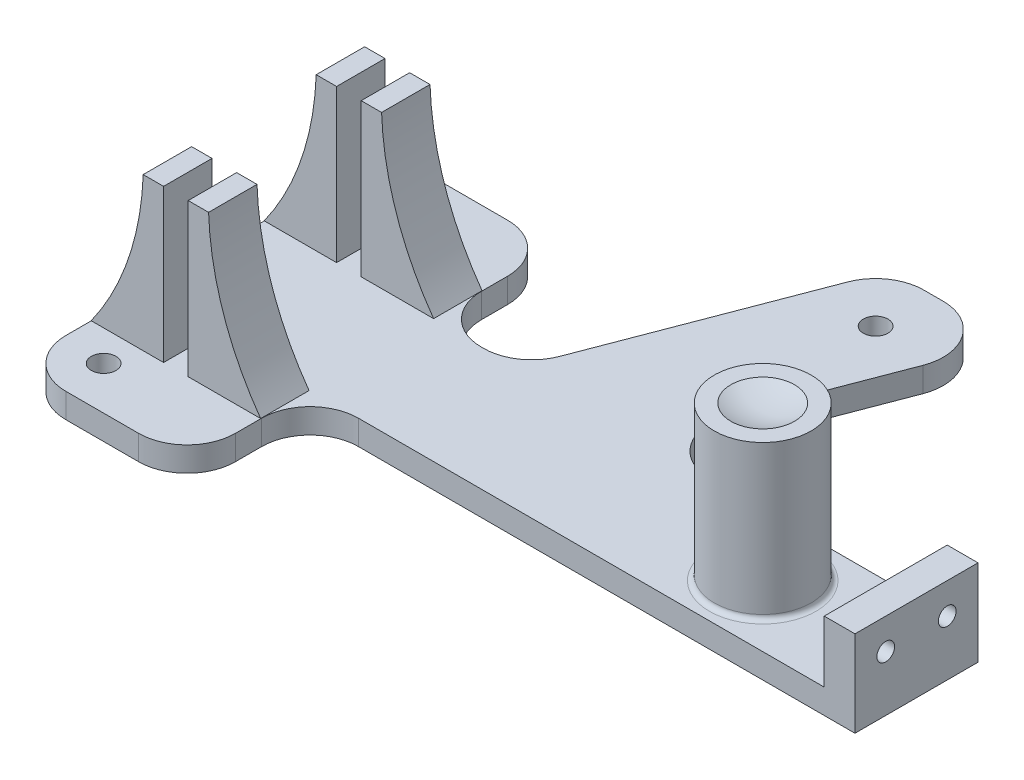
ISO-10303-21;
HEADER;
FILE_DESCRIPTION(('STEP AP214'),'2;1');
FILE_NAME('part.step','',(''),(''),'','','');
FILE_SCHEMA(('AUTOMOTIVE_DESIGN { 1 0 10303 214 1 1 1 1 }'));
ENDSEC;
DATA;
#1=APPLICATION_CONTEXT('core data for automotive mechanical design processes');
#2=APPLICATION_PROTOCOL_DEFINITION('international standard','automotive_design',2000,#1);
#3=PRODUCT_CONTEXT('',#1,'mechanical');
#4=PRODUCT('Part','Part','',(#3));
#5=PRODUCT_RELATED_PRODUCT_CATEGORY('part','',(#4));
#6=PRODUCT_DEFINITION_FORMATION('','',#4);
#7=PRODUCT_DEFINITION_CONTEXT('part definition',#1,'design');
#8=PRODUCT_DEFINITION('design','',#6,#7);
#9=PRODUCT_DEFINITION_SHAPE('','',#8);
#10=(LENGTH_UNIT() NAMED_UNIT(*) SI_UNIT(.MILLI.,.METRE.));
#11=(NAMED_UNIT(*) PLANE_ANGLE_UNIT() SI_UNIT($,.RADIAN.));
#12=(NAMED_UNIT(*) SI_UNIT($,.STERADIAN.) SOLID_ANGLE_UNIT());
#13=UNCERTAINTY_MEASURE_WITH_UNIT(LENGTH_MEASURE(1.E-05),#10,'distance_accuracy_value','');
#14=(GEOMETRIC_REPRESENTATION_CONTEXT(3) GLOBAL_UNCERTAINTY_ASSIGNED_CONTEXT((#13)) GLOBAL_UNIT_ASSIGNED_CONTEXT((#10,
#11,#12)) REPRESENTATION_CONTEXT('',''));
#15=CARTESIAN_POINT('',(0.,0.,0.));
#16=DIRECTION('',(0.,0.,1.));
#17=DIRECTION('',(1.,0.,0.));
#18=AXIS2_PLACEMENT_3D('',#15,#16,#17);
#19=CARTESIAN_POINT('',(30.08,0.,22.7));
#20=DIRECTION('',(0.,1.,0.));
#21=DIRECTION('',(0.,0.,1.));
#22=AXIS2_PLACEMENT_3D('',#19,#20,#21);
#23=PLANE('',#22);
#24=CARTESIAN_POINT('',(118.62,0.,0.));
#25=DIRECTION('',(0.,1.,0.));
#26=DIRECTION('',(0.,0.,1.));
#27=AXIS2_PLACEMENT_3D('',#24,#25,#26);
#28=CIRCLE('',#27,2.54);
#29=CARTESIAN_POINT('',(118.62,0.,2.54));
#30=VERTEX_POINT('',#29);
#31=EDGE_CURVE('E943',#30,#30,#28,.F.);
#32=ORIENTED_EDGE('',*,*,#31,.T.);
#33=EDGE_LOOP('',(#32));
#34=FACE_BOUND('',#33,.T.);
#35=CARTESIAN_POINT('',(67.0011743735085,0.,-57.15));
#36=DIRECTION('',(0.,1.,0.));
#37=DIRECTION('',(0.,0.,1.));
#38=AXIS2_PLACEMENT_3D('',#35,#36,#37);
#39=CIRCLE('',#38,2.54);
#40=CARTESIAN_POINT('',(67.0011743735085,0.,-54.61));
#41=VERTEX_POINT('',#40);
#42=EDGE_CURVE('E948',#41,#41,#39,.F.);
#43=ORIENTED_EDGE('',*,*,#42,.T.);
#44=EDGE_LOOP('',(#43));
#45=FACE_BOUND('',#44,.T.);
#46=CARTESIAN_POINT('',(-6.03,0.,-29.21));
#47=DIRECTION('',(0.,1.,0.));
#48=DIRECTION('',(0.,0.,1.));
#49=AXIS2_PLACEMENT_3D('',#46,#47,#48);
#50=CIRCLE('',#49,2.54);
#51=CARTESIAN_POINT('',(-6.03,0.,-26.67));
#52=VERTEX_POINT('',#51);
#53=EDGE_CURVE('E956',#52,#52,#50,.F.);
#54=ORIENTED_EDGE('',*,*,#53,.T.);
#55=EDGE_LOOP('',(#54));
#56=FACE_BOUND('',#55,.T.);
#57=CARTESIAN_POINT('',(-6.03,0.,29.21));
#58=DIRECTION('',(0.,1.,0.));
#59=DIRECTION('',(0.,0.,1.));
#60=AXIS2_PLACEMENT_3D('',#57,#58,#59);
#61=CIRCLE('',#60,2.54);
#62=CARTESIAN_POINT('',(-6.03,0.,31.75));
#63=VERTEX_POINT('',#62);
#64=EDGE_CURVE('E961',#63,#63,#61,.F.);
#65=ORIENTED_EDGE('',*,*,#64,.T.);
#66=EDGE_LOOP('',(#65));
#67=FACE_BOUND('',#66,.T.);
#68=CARTESIAN_POINT('',(100.84,0.,0.));
#69=DIRECTION('',(0.,1.,0.));
#70=DIRECTION('',(0.,0.,1.));
#71=AXIS2_PLACEMENT_3D('',#68,#69,#70);
#72=CIRCLE('',#71,11.);
#73=CARTESIAN_POINT('',(100.84,0.,11.));
#74=VERTEX_POINT('',#73);
#75=EDGE_CURVE('E624',#74,#74,#72,.F.);
#76=ORIENTED_EDGE('',*,*,#75,.T.);
#77=EDGE_LOOP('',(#76));
#78=FACE_BOUND('',#77,.T.);
#79=DIRECTION('',(0.,0.,1.));
#80=VECTOR('',#79,1.);
#81=CARTESIAN_POINT('',(5.08,0.,12.86));
#82=LINE('',#81,#80);
#83=CARTESIAN_POINT('',(5.08,0.,12.86));
#84=VERTEX_POINT('',#83);
#85=CARTESIAN_POINT('',(5.08,0.,22.86));
#86=VERTEX_POINT('',#85);
#87=EDGE_CURVE('E461',#84,#86,#82,.T.);
#88=ORIENTED_EDGE('',*,*,#87,.F.);
#89=DIRECTION('',(1.,0.,0.));
#90=VECTOR('',#89,1.);
#91=CARTESIAN_POINT('',(5.08,0.,12.86));
#92=LINE('',#91,#90);
#93=CARTESIAN_POINT('',(20.033299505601,0.,12.86));
#94=VERTEX_POINT('',#93);
#95=EDGE_CURVE('E452',#84,#94,#92,.T.);
#96=ORIENTED_EDGE('',*,*,#95,.T.);
#97=DIRECTION('',(0.,0.,1.));
#98=VECTOR('',#97,1.);
#99=CARTESIAN_POINT('',(20.033299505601,0.,12.86));
#100=LINE('',#99,#98);
#101=CARTESIAN_POINT('',(20.033299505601,0.,22.86));
#102=VERTEX_POINT('',#101);
#103=EDGE_CURVE('E477',#94,#102,#100,.T.);
#104=ORIENTED_EDGE('',*,*,#103,.T.);
#105=DIRECTION('',(1.,0.,0.));
#106=VECTOR('',#105,1.);
#107=CARTESIAN_POINT('',(5.08,0.,22.86));
#108=LINE('',#107,#106);
#109=EDGE_CURVE('E464',#86,#102,#108,.T.);
#110=ORIENTED_EDGE('',*,*,#109,.F.);
#111=EDGE_LOOP('',(#88,#96,#104,#110));
#112=FACE_BOUND('',#111,.T.);
#113=DIRECTION('',(0.,0.,-1.));
#114=VECTOR('',#113,1.);
#115=CARTESIAN_POINT('',(20.033299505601,0.,-12.86));
#116=LINE('',#115,#114);
#117=CARTESIAN_POINT('',(20.033299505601,0.,-12.86));
#118=VERTEX_POINT('',#117);
#119=CARTESIAN_POINT('',(20.033299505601,0.,-22.86));
#120=VERTEX_POINT('',#119);
#121=EDGE_CURVE('E407',#118,#120,#116,.T.);
#122=ORIENTED_EDGE('',*,*,#121,.F.);
#123=DIRECTION('',(1.,0.,0.));
#124=VECTOR('',#123,1.);
#125=CARTESIAN_POINT('',(5.08,0.,-12.86));
#126=LINE('',#125,#124);
#127=CARTESIAN_POINT('',(5.08,0.,-12.86));
#128=VERTEX_POINT('',#127);
#129=EDGE_CURVE('E393',#128,#118,#126,.T.);
#130=ORIENTED_EDGE('',*,*,#129,.F.);
#131=DIRECTION('',(0.,0.,-1.));
#132=VECTOR('',#131,1.);
#133=CARTESIAN_POINT('',(5.08,0.,-12.86));
#134=LINE('',#133,#132);
#135=CARTESIAN_POINT('',(5.08,0.,-22.86));
#136=VERTEX_POINT('',#135);
#137=EDGE_CURVE('E404',#128,#136,#134,.T.);
#138=ORIENTED_EDGE('',*,*,#137,.T.);
#139=DIRECTION('',(1.,0.,0.));
#140=VECTOR('',#139,1.);
#141=CARTESIAN_POINT('',(5.08,0.,-22.86));
#142=LINE('',#141,#140);
#143=EDGE_CURVE('E389',#136,#120,#142,.T.);
#144=ORIENTED_EDGE('',*,*,#143,.T.);
#145=EDGE_LOOP('',(#122,#130,#138,#144));
#146=FACE_BOUND('',#145,.T.);
#147=DIRECTION('',(1.,0.,0.));
#148=VECTOR('',#147,1.);
#149=CARTESIAN_POINT('',(30.08,0.,12.7));
#150=LINE('',#149,#148);
#151=CARTESIAN_POINT('',(30.08,0.,12.7));
#152=VERTEX_POINT('',#151);
#153=CARTESIAN_POINT('',(126.24,0.,12.7));
#154=VERTEX_POINT('',#153);
#155=EDGE_CURVE('E48',#152,#154,#150,.T.);
#156=ORIENTED_EDGE('',*,*,#155,.T.);
#157=DIRECTION('',(0.,0.,1.));
#158=VECTOR('',#157,1.);
#159=CARTESIAN_POINT('',(126.24,0.,12.7));
#160=LINE('',#159,#158);
#161=CARTESIAN_POINT('',(126.24,0.,-12.7));
#162=VERTEX_POINT('',#161);
#163=EDGE_CURVE('E52',#162,#154,#160,.T.);
#164=ORIENTED_EDGE('',*,*,#163,.F.);
#165=DIRECTION('',(-1.,0.,0.));
#166=VECTOR('',#165,1.);
#167=CARTESIAN_POINT('',(30.08,0.,-12.7));
#168=LINE('',#167,#166);
#169=CARTESIAN_POINT('',(77.2590686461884,0.,-12.7));
#170=VERTEX_POINT('',#169);
#171=EDGE_CURVE('E556',#162,#170,#168,.T.);
#172=ORIENTED_EDGE('',*,*,#171,.T.);
#173=CARTESIAN_POINT('',(77.2590686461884,0.,-22.7));
#174=DIRECTION('',(0.,1.,0.));
#175=DIRECTION('',(0.,0.,1.));
#176=AXIS2_PLACEMENT_3D('',#173,#174,#175);
#177=CIRCLE('',#176,10.);
#178=CARTESIAN_POINT('',(67.9161394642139,0.,-26.2650630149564));
#179=VERTEX_POINT('',#178);
#180=EDGE_CURVE('E41',#170,#179,#177,.F.);
#181=ORIENTED_EDGE('',*,*,#180,.T.);
#182=DIRECTION('',(0.356506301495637,0.,-0.934292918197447));
#183=VECTOR('',#182,1.);
#184=CARTESIAN_POINT('',(78.8864797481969,0.,-55.0149369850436));
#185=LINE('',#184,#183);
#186=CARTESIAN_POINT('',(78.8864797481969,0.,-55.0149369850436));
#187=VERTEX_POINT('',#186);
#188=EDGE_CURVE('E341',#179,#187,#185,.T.);
#189=ORIENTED_EDGE('',*,*,#188,.T.);
#190=CARTESIAN_POINT('',(69.5435505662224,0.,-58.58));
#191=DIRECTION('',(0.,1.,0.));
#192=DIRECTION('',(0.,0.,-1.));
#193=AXIS2_PLACEMENT_3D('',#190,#191,#192);
#194=CIRCLE('',#193,10.);
#195=CARTESIAN_POINT('',(69.5435505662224,0.,-68.58));
#196=VERTEX_POINT('',#195);
#197=EDGE_CURVE('E359',#187,#196,#194,.T.);
#198=ORIENTED_EDGE('',*,*,#197,.T.);
#199=DIRECTION('',(-1.,0.,0.));
#200=VECTOR('',#199,1.);
#201=CARTESIAN_POINT('',(65.5501133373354,0.,-68.58));
#202=LINE('',#201,#200);
#203=CARTESIAN_POINT('',(65.5501133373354,0.,-68.58));
#204=VERTEX_POINT('',#203);
#205=EDGE_CURVE('E362',#196,#204,#202,.T.);
#206=ORIENTED_EDGE('',*,*,#205,.T.);
#207=CARTESIAN_POINT('',(65.5501133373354,0.,-58.58));
#208=DIRECTION('',(0.,1.,0.));
#209=DIRECTION('',(0.,0.,-1.));
#210=AXIS2_PLACEMENT_3D('',#207,#208,#209);
#211=CIRCLE('',#210,10.);
#212=CARTESIAN_POINT('',(56.2071841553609,0.,-62.1450630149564));
#213=VERTEX_POINT('',#212);
#214=EDGE_CURVE('E365',#204,#213,#211,.T.);
#215=ORIENTED_EDGE('',*,*,#214,.T.);
#216=DIRECTION('',(-0.356506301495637,0.,0.934292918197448));
#217=VECTOR('',#216,1.);
#218=CARTESIAN_POINT('',(37.34,0.,-12.7));
#219=LINE('',#218,#217);
#220=CARTESIAN_POINT('',(39.7954350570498,0.,-19.1349369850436));
#221=VERTEX_POINT('',#220);
#222=EDGE_CURVE('E345',#213,#221,#219,.T.);
#223=ORIENTED_EDGE('',*,*,#222,.T.);
#224=CARTESIAN_POINT('',(30.4525058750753,0.,-22.7));
#225=DIRECTION('',(0.,1.,0.));
#226=DIRECTION('',(0.,0.,1.));
#227=AXIS2_PLACEMENT_3D('',#224,#225,#226);
#228=CIRCLE('',#227,10.);
#229=CARTESIAN_POINT('',(30.4525058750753,0.,-12.7));
#230=VERTEX_POINT('',#229);
#231=EDGE_CURVE('E632',#221,#230,#228,.F.);
#232=ORIENTED_EDGE('',*,*,#231,.T.);
#233=CARTESIAN_POINT('',(30.08,0.,-12.7));
#234=VERTEX_POINT('',#233);
#235=EDGE_CURVE('E510',#230,#234,#168,.T.);
#236=ORIENTED_EDGE('',*,*,#235,.T.);
#237=CARTESIAN_POINT('',(30.08,0.,-22.7));
#238=DIRECTION('',(0.,-1.,0.));
#239=DIRECTION('',(0.,0.,1.));
#240=AXIS2_PLACEMENT_3D('',#237,#238,#239);
#241=CIRCLE('',#240,10.);
#242=CARTESIAN_POINT('',(20.08,0.,-22.7));
#243=VERTEX_POINT('',#242);
#244=EDGE_CURVE('E558',#234,#243,#241,.T.);
#245=ORIENTED_EDGE('',*,*,#244,.T.);
#246=DIRECTION('',(0.,0.,-1.));
#247=VECTOR('',#246,1.);
#248=CARTESIAN_POINT('',(20.08,0.,-28.1));
#249=LINE('',#248,#247);
#250=CARTESIAN_POINT('',(20.08,0.,-28.1));
#251=VERTEX_POINT('',#250);
#252=EDGE_CURVE('E561',#243,#251,#249,.T.);
#253=ORIENTED_EDGE('',*,*,#252,.T.);
#254=CARTESIAN_POINT('',(10.08,0.,-28.1));
#255=DIRECTION('',(0.,1.,0.));
#256=DIRECTION('',(0.,0.,1.));
#257=AXIS2_PLACEMENT_3D('',#254,#255,#256);
#258=CIRCLE('',#257,10.);
#259=CARTESIAN_POINT('',(10.08,0.,-38.1));
#260=VERTEX_POINT('',#259);
#261=EDGE_CURVE('E564',#251,#260,#258,.T.);
#262=ORIENTED_EDGE('',*,*,#261,.T.);
#263=DIRECTION('',(-1.,0.,0.));
#264=VECTOR('',#263,1.);
#265=CARTESIAN_POINT('',(-4.92,0.,-38.1));
#266=LINE('',#265,#264);
#267=CARTESIAN_POINT('',(-4.91999999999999,0.,-38.1));
#268=VERTEX_POINT('',#267);
#269=EDGE_CURVE('E567',#260,#268,#266,.T.);
#270=ORIENTED_EDGE('',*,*,#269,.T.);
#271=CARTESIAN_POINT('',(-4.92,0.,-28.1));
#272=DIRECTION('',(0.,1.,0.));
#273=DIRECTION('',(0.,0.,1.));
#274=AXIS2_PLACEMENT_3D('',#271,#272,#273);
#275=CIRCLE('',#274,10.);
#276=CARTESIAN_POINT('',(-14.92,0.,-28.1));
#277=VERTEX_POINT('',#276);
#278=EDGE_CURVE('E570',#268,#277,#275,.T.);
#279=ORIENTED_EDGE('',*,*,#278,.T.);
#280=DIRECTION('',(0.,0.,1.));
#281=VECTOR('',#280,1.);
#282=CARTESIAN_POINT('',(-14.92,0.,-28.1));
#283=LINE('',#282,#281);
#284=CARTESIAN_POINT('',(-14.92,0.,-22.86));
#285=VERTEX_POINT('',#284);
#286=EDGE_CURVE('E574',#277,#285,#283,.T.);
#287=ORIENTED_EDGE('',*,*,#286,.T.);
#288=DIRECTION('',(1.,0.,0.));
#289=VECTOR('',#288,1.);
#290=CARTESIAN_POINT('',(0.,0.,-22.86));
#291=LINE('',#290,#289);
#292=CARTESIAN_POINT('',(0.,0.,-22.86));
#293=VERTEX_POINT('',#292);
#294=EDGE_CURVE('E430',#285,#293,#291,.T.);
#295=ORIENTED_EDGE('',*,*,#294,.T.);
#296=DIRECTION('',(0.,0.,-1.));
#297=VECTOR('',#296,1.);
#298=CARTESIAN_POINT('',(0.,0.,-12.86));
#299=LINE('',#298,#297);
#300=CARTESIAN_POINT('',(0.,0.,-12.86));
#301=VERTEX_POINT('',#300);
#302=EDGE_CURVE('E427',#301,#293,#299,.T.);
#303=ORIENTED_EDGE('',*,*,#302,.F.);
#304=DIRECTION('',(1.,0.,0.));
#305=VECTOR('',#304,1.);
#306=CARTESIAN_POINT('',(0.,0.,-12.86));
#307=LINE('',#306,#305);
#308=CARTESIAN_POINT('',(-14.92,0.,-12.86));
#309=VERTEX_POINT('',#308);
#310=EDGE_CURVE('E418',#309,#301,#307,.T.);
#311=ORIENTED_EDGE('',*,*,#310,.F.);
#312=CARTESIAN_POINT('',(-14.92,0.,12.86));
#313=VERTEX_POINT('',#312);
#314=EDGE_CURVE('E579',#309,#313,#283,.T.);
#315=ORIENTED_EDGE('',*,*,#314,.T.);
#316=DIRECTION('',(1.,0.,0.));
#317=VECTOR('',#316,1.);
#318=CARTESIAN_POINT('',(0.,0.,12.86));
#319=LINE('',#318,#317);
#320=CARTESIAN_POINT('',(0.,0.,12.86));
#321=VERTEX_POINT('',#320);
#322=EDGE_CURVE('E495',#313,#321,#319,.T.);
#323=ORIENTED_EDGE('',*,*,#322,.T.);
#324=DIRECTION('',(0.,0.,1.));
#325=VECTOR('',#324,1.);
#326=CARTESIAN_POINT('',(0.,0.,12.86));
#327=LINE('',#326,#325);
#328=CARTESIAN_POINT('',(0.,0.,22.86));
#329=VERTEX_POINT('',#328);
#330=EDGE_CURVE('E507',#321,#329,#327,.T.);
#331=ORIENTED_EDGE('',*,*,#330,.T.);
#332=DIRECTION('',(1.,0.,0.));
#333=VECTOR('',#332,1.);
#334=CARTESIAN_POINT('',(0.,0.,22.86));
#335=LINE('',#334,#333);
#336=CARTESIAN_POINT('',(-14.92,0.,22.86));
#337=VERTEX_POINT('',#336);
#338=EDGE_CURVE('E506',#337,#329,#335,.T.);
#339=ORIENTED_EDGE('',*,*,#338,.F.);
#340=CARTESIAN_POINT('',(-14.92,0.,28.1));
#341=VERTEX_POINT('',#340);
#342=EDGE_CURVE('E573',#337,#341,#283,.T.);
#343=ORIENTED_EDGE('',*,*,#342,.T.);
#344=CARTESIAN_POINT('',(-4.92,0.,28.1));
#345=DIRECTION('',(0.,1.,0.));
#346=DIRECTION('',(0.,0.,1.));
#347=AXIS2_PLACEMENT_3D('',#344,#345,#346);
#348=CIRCLE('',#347,10.);
#349=CARTESIAN_POINT('',(-4.92,0.,38.1));
#350=VERTEX_POINT('',#349);
#351=EDGE_CURVE('E577',#341,#350,#348,.T.);
#352=ORIENTED_EDGE('',*,*,#351,.T.);
#353=DIRECTION('',(1.,0.,0.));
#354=VECTOR('',#353,1.);
#355=CARTESIAN_POINT('',(-4.92,0.,38.1));
#356=LINE('',#355,#354);
#357=CARTESIAN_POINT('',(10.08,0.,38.1));
#358=VERTEX_POINT('',#357);
#359=EDGE_CURVE('E583',#350,#358,#356,.T.);
#360=ORIENTED_EDGE('',*,*,#359,.T.);
#361=CARTESIAN_POINT('',(10.08,0.,28.1));
#362=DIRECTION('',(0.,1.,0.));
#363=DIRECTION('',(0.,0.,-1.));
#364=AXIS2_PLACEMENT_3D('',#361,#362,#363);
#365=CIRCLE('',#364,10.);
#366=CARTESIAN_POINT('',(20.08,0.,28.1));
#367=VERTEX_POINT('',#366);
#368=EDGE_CURVE('E586',#358,#367,#365,.T.);
#369=ORIENTED_EDGE('',*,*,#368,.T.);
#370=DIRECTION('',(0.,0.,-1.));
#371=VECTOR('',#370,1.);
#372=CARTESIAN_POINT('',(20.08,0.,28.1));
#373=LINE('',#372,#371);
#374=CARTESIAN_POINT('',(20.08,0.,22.7));
#375=VERTEX_POINT('',#374);
#376=EDGE_CURVE('E589',#367,#375,#373,.T.);
#377=ORIENTED_EDGE('',*,*,#376,.T.);
#378=CARTESIAN_POINT('',(30.08,0.,22.7));
#379=DIRECTION('',(0.,-1.,0.));
#380=DIRECTION('',(0.,0.,1.));
#381=AXIS2_PLACEMENT_3D('',#378,#379,#380);
#382=CIRCLE('',#381,10.);
#383=EDGE_CURVE('E592',#375,#152,#382,.T.);
#384=ORIENTED_EDGE('',*,*,#383,.T.);
#385=EDGE_LOOP('',(#156,#164,#172,#181,#189,#198,#206,#215,#223,#232,#236,#245,#253,#262,#270,
#279,#287,#295,#303,#311,#315,#323,#331,#339,#343,#352,#360,#369,#377,#384));
#386=FACE_BOUND('',#385,.T.);
#387=ADVANCED_FACE('F33',(#34,#45,#56,#67,#78,#112,#146,#386),#23,.T.);
#388=CARTESIAN_POINT('',(30.08,-5.08,-12.7));
#389=DIRECTION('',(0.,0.,-1.));
#390=DIRECTION('',(-1.,0.,0.));
#391=AXIS2_PLACEMENT_3D('',#388,#389,#390);
#392=PLANE('',#391);
#393=ORIENTED_EDGE('',*,*,#235,.F.);
#394=DIRECTION('',(0.,1.,0.));
#395=VECTOR('',#394,1.);
#396=CARTESIAN_POINT('',(30.4525058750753,-5.08,-12.7));
#397=LINE('',#396,#395);
#398=CARTESIAN_POINT('',(30.4525058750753,-5.08,-12.7));
#399=VERTEX_POINT('',#398);
#400=EDGE_CURVE('E630',#230,#399,#397,.F.);
#401=ORIENTED_EDGE('',*,*,#400,.T.);
#402=DIRECTION('',(-1.,0.,0.));
#403=VECTOR('',#402,1.);
#404=CARTESIAN_POINT('',(132.59,-5.08,-12.7));
#405=LINE('',#404,#403);
#406=CARTESIAN_POINT('',(30.08,-5.08,-12.7));
#407=VERTEX_POINT('',#406);
#408=EDGE_CURVE('E520',#399,#407,#405,.T.);
#409=ORIENTED_EDGE('',*,*,#408,.T.);
#410=DIRECTION('',(0.,1.,0.));
#411=VECTOR('',#410,1.);
#412=CARTESIAN_POINT('',(30.08,-5.08,-12.7));
#413=LINE('',#412,#411);
#414=EDGE_CURVE('E313',#407,#234,#413,.T.);
#415=ORIENTED_EDGE('',*,*,#414,.T.);
#416=EDGE_LOOP('',(#393,#401,#409,#415));
#417=FACE_BOUND('',#416,.T.);
#418=ADVANCED_FACE('F710',(#417),#392,.T.);
#419=CARTESIAN_POINT('',(30.08,-5.08,12.7));
#420=DIRECTION('',(0.,0.,1.));
#421=DIRECTION('',(1.,0.,0.));
#422=AXIS2_PLACEMENT_3D('',#419,#420,#421);
#423=PLANE('',#422);
#424=ORIENTED_EDGE('',*,*,#155,.F.);
#425=DIRECTION('',(0.,1.,0.));
#426=VECTOR('',#425,1.);
#427=CARTESIAN_POINT('',(30.08,-5.08,12.7));
#428=LINE('',#427,#426);
#429=CARTESIAN_POINT('',(30.08,-5.08,12.7));
#430=VERTEX_POINT('',#429);
#431=EDGE_CURVE('E595',#430,#152,#428,.T.);
#432=ORIENTED_EDGE('',*,*,#431,.F.);
#433=DIRECTION('',(1.,0.,0.));
#434=VECTOR('',#433,1.);
#435=CARTESIAN_POINT('',(132.59,-5.08,12.7));
#436=LINE('',#435,#434);
#437=CARTESIAN_POINT('',(132.59,-5.08,12.7));
#438=VERTEX_POINT('',#437);
#439=EDGE_CURVE('E516',#430,#438,#436,.T.);
#440=ORIENTED_EDGE('',*,*,#439,.T.);
#441=DIRECTION('',(0.,1.,0.));
#442=VECTOR('',#441,1.);
#443=CARTESIAN_POINT('',(132.59,-5.08,12.7));
#444=LINE('',#443,#442);
#445=CARTESIAN_POINT('',(132.59,12.7,12.7));
#446=VERTEX_POINT('',#445);
#447=EDGE_CURVE('E314',#438,#446,#444,.T.);
#448=ORIENTED_EDGE('',*,*,#447,.T.);
#449=DIRECTION('',(1.,0.,0.));
#450=VECTOR('',#449,1.);
#451=CARTESIAN_POINT('',(132.59,12.7,12.7));
#452=LINE('',#451,#450);
#453=CARTESIAN_POINT('',(126.24,12.7,12.7));
#454=VERTEX_POINT('',#453);
#455=EDGE_CURVE('E328',#454,#446,#452,.T.);
#456=ORIENTED_EDGE('',*,*,#455,.F.);
#457=DIRECTION('',(0.,-1.,0.));
#458=VECTOR('',#457,1.);
#459=CARTESIAN_POINT('',(126.24,12.7,12.7));
#460=LINE('',#459,#458);
#461=EDGE_CURVE('E336',#454,#154,#460,.T.);
#462=ORIENTED_EDGE('',*,*,#461,.T.);
#463=EDGE_LOOP('',(#424,#432,#440,#448,#456,#462));
#464=FACE_BOUND('',#463,.T.);
#465=ADVANCED_FACE('F658',(#464),#423,.T.);
#466=CARTESIAN_POINT('',(30.08,-5.08,22.7));
#467=DIRECTION('',(0.,1.,0.));
#468=DIRECTION('',(0.,0.,1.));
#469=AXIS2_PLACEMENT_3D('',#466,#467,#468);
#470=CYLINDRICAL_SURFACE('',#469,10.);
#471=ORIENTED_EDGE('',*,*,#383,.F.);
#472=DIRECTION('',(0.,1.,0.));
#473=VECTOR('',#472,1.);
#474=CARTESIAN_POINT('',(20.08,-5.08,22.7));
#475=LINE('',#474,#473);
#476=CARTESIAN_POINT('',(20.08,-5.08,22.7));
#477=VERTEX_POINT('',#476);
#478=EDGE_CURVE('E597',#477,#375,#475,.T.);
#479=ORIENTED_EDGE('',*,*,#478,.F.);
#480=CARTESIAN_POINT('',(30.08,-5.08,22.7));
#481=DIRECTION('',(0.,-1.,0.));
#482=DIRECTION('',(0.,0.,1.));
#483=AXIS2_PLACEMENT_3D('',#480,#481,#482);
#484=CIRCLE('',#483,10.);
#485=EDGE_CURVE('E553',#477,#430,#484,.T.);
#486=ORIENTED_EDGE('',*,*,#485,.T.);
#487=ORIENTED_EDGE('',*,*,#431,.T.);
#488=EDGE_LOOP('',(#471,#479,#486,#487));
#489=FACE_BOUND('',#488,.T.);
#490=ADVANCED_FACE('F664',(#489),#470,.F.);
#491=CARTESIAN_POINT('',(20.08,-5.08,28.1));
#492=DIRECTION('',(1.,0.,0.));
#493=DIRECTION('',(0.,0.,-1.));
#494=AXIS2_PLACEMENT_3D('',#491,#492,#493);
#495=PLANE('',#494);
#496=ORIENTED_EDGE('',*,*,#376,.F.);
#497=DIRECTION('',(0.,1.,0.));
#498=VECTOR('',#497,1.);
#499=CARTESIAN_POINT('',(20.08,-5.08,28.1));
#500=LINE('',#499,#498);
#501=CARTESIAN_POINT('',(20.08,-5.08,28.1));
#502=VERTEX_POINT('',#501);
#503=EDGE_CURVE('E599',#502,#367,#500,.T.);
#504=ORIENTED_EDGE('',*,*,#503,.F.);
#505=DIRECTION('',(0.,0.,-1.));
#506=VECTOR('',#505,1.);
#507=CARTESIAN_POINT('',(20.08,-5.08,28.1));
#508=LINE('',#507,#506);
#509=EDGE_CURVE('E550',#502,#477,#508,.T.);
#510=ORIENTED_EDGE('',*,*,#509,.T.);
#511=ORIENTED_EDGE('',*,*,#478,.T.);
#512=EDGE_LOOP('',(#496,#504,#510,#511));
#513=FACE_BOUND('',#512,.T.);
#514=ADVANCED_FACE('F667',(#513),#495,.T.);
#515=CARTESIAN_POINT('',(10.08,-5.08,28.1));
#516=DIRECTION('',(0.,1.,0.));
#517=DIRECTION('',(0.,0.,1.));
#518=AXIS2_PLACEMENT_3D('',#515,#516,#517);
#519=CYLINDRICAL_SURFACE('',#518,10.);
#520=ORIENTED_EDGE('',*,*,#368,.F.);
#521=DIRECTION('',(0.,1.,0.));
#522=VECTOR('',#521,1.);
#523=CARTESIAN_POINT('',(10.08,-5.08,38.1));
#524=LINE('',#523,#522);
#525=CARTESIAN_POINT('',(10.08,-5.08,38.1));
#526=VERTEX_POINT('',#525);
#527=EDGE_CURVE('E601',#526,#358,#524,.T.);
#528=ORIENTED_EDGE('',*,*,#527,.F.);
#529=CARTESIAN_POINT('',(10.08,-5.08,28.1));
#530=DIRECTION('',(0.,1.,0.));
#531=DIRECTION('',(0.,0.,-1.));
#532=AXIS2_PLACEMENT_3D('',#529,#530,#531);
#533=CIRCLE('',#532,10.);
#534=EDGE_CURVE('E547',#526,#502,#533,.T.);
#535=ORIENTED_EDGE('',*,*,#534,.T.);
#536=ORIENTED_EDGE('',*,*,#503,.T.);
#537=EDGE_LOOP('',(#520,#528,#535,#536));
#538=FACE_BOUND('',#537,.T.);
#539=ADVANCED_FACE('F672',(#538),#519,.T.);
#540=CARTESIAN_POINT('',(-4.92,-5.08,38.1));
#541=DIRECTION('',(0.,0.,1.));
#542=DIRECTION('',(1.,0.,0.));
#543=AXIS2_PLACEMENT_3D('',#540,#541,#542);
#544=PLANE('',#543);
#545=ORIENTED_EDGE('',*,*,#359,.F.);
#546=DIRECTION('',(0.,1.,0.));
#547=VECTOR('',#546,1.);
#548=CARTESIAN_POINT('',(-4.92,-5.08,38.1));
#549=LINE('',#548,#547);
#550=CARTESIAN_POINT('',(-4.92,-5.08,38.1));
#551=VERTEX_POINT('',#550);
#552=EDGE_CURVE('E603',#551,#350,#549,.T.);
#553=ORIENTED_EDGE('',*,*,#552,.F.);
#554=DIRECTION('',(1.,0.,0.));
#555=VECTOR('',#554,1.);
#556=CARTESIAN_POINT('',(-4.92,-5.08,38.1));
#557=LINE('',#556,#555);
#558=EDGE_CURVE('E544',#551,#526,#557,.T.);
#559=ORIENTED_EDGE('',*,*,#558,.T.);
#560=ORIENTED_EDGE('',*,*,#527,.T.);
#561=EDGE_LOOP('',(#545,#553,#559,#560));
#562=FACE_BOUND('',#561,.T.);
#563=ADVANCED_FACE('F675',(#562),#544,.T.);
#564=CARTESIAN_POINT('',(-4.92,-5.08,28.1));
#565=DIRECTION('',(0.,1.,0.));
#566=DIRECTION('',(0.,0.,1.));
#567=AXIS2_PLACEMENT_3D('',#564,#565,#566);
#568=CYLINDRICAL_SURFACE('',#567,10.);
#569=ORIENTED_EDGE('',*,*,#351,.F.);
#570=DIRECTION('',(0.,1.,0.));
#571=VECTOR('',#570,1.);
#572=CARTESIAN_POINT('',(-14.92,-5.08,28.1));
#573=LINE('',#572,#571);
#574=CARTESIAN_POINT('',(-14.92,-5.08,28.1));
#575=VERTEX_POINT('',#574);
#576=EDGE_CURVE('E605',#575,#341,#573,.T.);
#577=ORIENTED_EDGE('',*,*,#576,.F.);
#578=CARTESIAN_POINT('',(-4.92,-5.08,28.1));
#579=DIRECTION('',(0.,1.,0.));
#580=DIRECTION('',(0.,0.,1.));
#581=AXIS2_PLACEMENT_3D('',#578,#579,#580);
#582=CIRCLE('',#581,10.);
#583=EDGE_CURVE('E541',#575,#551,#582,.T.);
#584=ORIENTED_EDGE('',*,*,#583,.T.);
#585=ORIENTED_EDGE('',*,*,#552,.T.);
#586=EDGE_LOOP('',(#569,#577,#584,#585));
#587=FACE_BOUND('',#586,.T.);
#588=ADVANCED_FACE('F680',(#587),#568,.T.);
#589=CARTESIAN_POINT('',(-14.92,-5.08,-28.1));
#590=DIRECTION('',(-1.,0.,0.));
#591=DIRECTION('',(0.,0.,1.));
#592=AXIS2_PLACEMENT_3D('',#589,#590,#591);
#593=PLANE('',#592);
#594=ORIENTED_EDGE('',*,*,#286,.F.);
#595=DIRECTION('',(0.,1.,0.));
#596=VECTOR('',#595,1.);
#597=CARTESIAN_POINT('',(-14.92,-5.08,-28.1));
#598=LINE('',#597,#596);
#599=CARTESIAN_POINT('',(-14.92,-5.08,-28.1));
#600=VERTEX_POINT('',#599);
#601=EDGE_CURVE('E608',#600,#277,#598,.T.);
#602=ORIENTED_EDGE('',*,*,#601,.F.);
#603=DIRECTION('',(0.,0.,1.));
#604=VECTOR('',#603,1.);
#605=CARTESIAN_POINT('',(-14.92,-5.08,-28.1));
#606=LINE('',#605,#604);
#607=EDGE_CURVE('E538',#600,#575,#606,.T.);
#608=ORIENTED_EDGE('',*,*,#607,.T.);
#609=ORIENTED_EDGE('',*,*,#576,.T.);
#610=ORIENTED_EDGE('',*,*,#342,.F.);
#611=EDGE_CURVE('E580',#313,#337,#283,.T.);
#612=ORIENTED_EDGE('',*,*,#611,.F.);
#613=ORIENTED_EDGE('',*,*,#314,.F.);
#614=EDGE_CURVE('E578',#285,#309,#283,.T.);
#615=ORIENTED_EDGE('',*,*,#614,.F.);
#616=EDGE_LOOP('',(#594,#602,#608,#609,#610,#612,#613,#615));
#617=FACE_BOUND('',#616,.T.);
#618=ADVANCED_FACE('F684',(#617),#593,.T.);
#619=CARTESIAN_POINT('',(-4.92,-5.08,-28.1));
#620=DIRECTION('',(0.,1.,0.));
#621=DIRECTION('',(0.,0.,1.));
#622=AXIS2_PLACEMENT_3D('',#619,#620,#621);
#623=CYLINDRICAL_SURFACE('',#622,10.);
#624=ORIENTED_EDGE('',*,*,#278,.F.);
#625=DIRECTION('',(0.,1.,0.));
#626=VECTOR('',#625,1.);
#627=CARTESIAN_POINT('',(-4.91999999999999,-5.08,-38.1));
#628=LINE('',#627,#626);
#629=CARTESIAN_POINT('',(-4.91999999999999,-5.08,-38.1));
#630=VERTEX_POINT('',#629);
#631=EDGE_CURVE('E610',#630,#268,#628,.T.);
#632=ORIENTED_EDGE('',*,*,#631,.F.);
#633=CARTESIAN_POINT('',(-4.92,-5.08,-28.1));
#634=DIRECTION('',(0.,1.,0.));
#635=DIRECTION('',(0.,0.,1.));
#636=AXIS2_PLACEMENT_3D('',#633,#634,#635);
#637=CIRCLE('',#636,10.);
#638=EDGE_CURVE('E535',#630,#600,#637,.T.);
#639=ORIENTED_EDGE('',*,*,#638,.T.);
#640=ORIENTED_EDGE('',*,*,#601,.T.);
#641=EDGE_LOOP('',(#624,#632,#639,#640));
#642=FACE_BOUND('',#641,.T.);
#643=ADVANCED_FACE('F690',(#642),#623,.T.);
#644=CARTESIAN_POINT('',(-4.92,-5.08,-38.1));
#645=DIRECTION('',(0.,0.,-1.));
#646=DIRECTION('',(-1.,0.,0.));
#647=AXIS2_PLACEMENT_3D('',#644,#645,#646);
#648=PLANE('',#647);
#649=ORIENTED_EDGE('',*,*,#269,.F.);
#650=DIRECTION('',(0.,1.,0.));
#651=VECTOR('',#650,1.);
#652=CARTESIAN_POINT('',(10.08,-5.08,-38.1));
#653=LINE('',#652,#651);
#654=CARTESIAN_POINT('',(10.08,-5.08,-38.1));
#655=VERTEX_POINT('',#654);
#656=EDGE_CURVE('E612',#655,#260,#653,.T.);
#657=ORIENTED_EDGE('',*,*,#656,.F.);
#658=DIRECTION('',(-1.,0.,0.));
#659=VECTOR('',#658,1.);
#660=CARTESIAN_POINT('',(-4.92,-5.08,-38.1));
#661=LINE('',#660,#659);
#662=EDGE_CURVE('E532',#655,#630,#661,.T.);
#663=ORIENTED_EDGE('',*,*,#662,.T.);
#664=ORIENTED_EDGE('',*,*,#631,.T.);
#665=EDGE_LOOP('',(#649,#657,#663,#664));
#666=FACE_BOUND('',#665,.T.);
#667=ADVANCED_FACE('F693',(#666),#648,.T.);
#668=CARTESIAN_POINT('',(10.08,-5.08,-28.1));
#669=DIRECTION('',(0.,1.,0.));
#670=DIRECTION('',(0.,0.,1.));
#671=AXIS2_PLACEMENT_3D('',#668,#669,#670);
#672=CYLINDRICAL_SURFACE('',#671,10.);
#673=ORIENTED_EDGE('',*,*,#261,.F.);
#674=DIRECTION('',(0.,1.,0.));
#675=VECTOR('',#674,1.);
#676=CARTESIAN_POINT('',(20.08,-5.08,-28.1));
#677=LINE('',#676,#675);
#678=CARTESIAN_POINT('',(20.08,-5.08,-28.1));
#679=VERTEX_POINT('',#678);
#680=EDGE_CURVE('E614',#679,#251,#677,.T.);
#681=ORIENTED_EDGE('',*,*,#680,.F.);
#682=CARTESIAN_POINT('',(10.08,-5.08,-28.1));
#683=DIRECTION('',(0.,1.,0.));
#684=DIRECTION('',(0.,0.,1.));
#685=AXIS2_PLACEMENT_3D('',#682,#683,#684);
#686=CIRCLE('',#685,10.);
#687=EDGE_CURVE('E529',#679,#655,#686,.T.);
#688=ORIENTED_EDGE('',*,*,#687,.T.);
#689=ORIENTED_EDGE('',*,*,#656,.T.);
#690=EDGE_LOOP('',(#673,#681,#688,#689));
#691=FACE_BOUND('',#690,.T.);
#692=ADVANCED_FACE('F698',(#691),#672,.T.);
#693=CARTESIAN_POINT('',(20.08,-5.08,-28.1));
#694=DIRECTION('',(1.,0.,0.));
#695=DIRECTION('',(0.,0.,-1.));
#696=AXIS2_PLACEMENT_3D('',#693,#694,#695);
#697=PLANE('',#696);
#698=ORIENTED_EDGE('',*,*,#252,.F.);
#699=DIRECTION('',(0.,1.,0.));
#700=VECTOR('',#699,1.);
#701=CARTESIAN_POINT('',(20.08,-5.08,-22.7));
#702=LINE('',#701,#700);
#703=CARTESIAN_POINT('',(20.08,-5.08,-22.7));
#704=VERTEX_POINT('',#703);
#705=EDGE_CURVE('E616',#704,#243,#702,.T.);
#706=ORIENTED_EDGE('',*,*,#705,.F.);
#707=DIRECTION('',(0.,0.,-1.));
#708=VECTOR('',#707,1.);
#709=CARTESIAN_POINT('',(20.08,-5.08,-28.1));
#710=LINE('',#709,#708);
#711=EDGE_CURVE('E526',#704,#679,#710,.T.);
#712=ORIENTED_EDGE('',*,*,#711,.T.);
#713=ORIENTED_EDGE('',*,*,#680,.T.);
#714=EDGE_LOOP('',(#698,#706,#712,#713));
#715=FACE_BOUND('',#714,.T.);
#716=ADVANCED_FACE('F701',(#715),#697,.T.);
#717=CARTESIAN_POINT('',(30.08,-5.08,-22.7));
#718=DIRECTION('',(0.,1.,0.));
#719=DIRECTION('',(0.,0.,1.));
#720=AXIS2_PLACEMENT_3D('',#717,#718,#719);
#721=CYLINDRICAL_SURFACE('',#720,10.);
#722=ORIENTED_EDGE('',*,*,#244,.F.);
#723=ORIENTED_EDGE('',*,*,#414,.F.);
#724=CARTESIAN_POINT('',(30.08,-5.08,-22.7));
#725=DIRECTION('',(0.,-1.,0.));
#726=DIRECTION('',(0.,0.,1.));
#727=AXIS2_PLACEMENT_3D('',#724,#725,#726);
#728=CIRCLE('',#727,10.);
#729=EDGE_CURVE('E523',#407,#704,#728,.T.);
#730=ORIENTED_EDGE('',*,*,#729,.T.);
#731=ORIENTED_EDGE('',*,*,#705,.T.);
#732=EDGE_LOOP('',(#722,#723,#730,#731));
#733=FACE_BOUND('',#732,.T.);
#734=ADVANCED_FACE('F707',(#733),#721,.F.);
#735=CARTESIAN_POINT('',(132.59,-5.08,-12.7));
#736=VERTEX_POINT('',#735);
#737=CARTESIAN_POINT('',(77.2590686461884,-5.08,-12.7));
#738=VERTEX_POINT('',#737);
#739=EDGE_CURVE('E521',#736,#738,#405,.T.);
#740=ORIENTED_EDGE('',*,*,#739,.T.);
#741=DIRECTION('',(0.,1.,0.));
#742=VECTOR('',#741,1.);
#743=CARTESIAN_POINT('',(77.2590686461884,0.,-12.7));
#744=LINE('',#743,#742);
#745=EDGE_CURVE('E636',#738,#170,#744,.T.);
#746=ORIENTED_EDGE('',*,*,#745,.T.);
#747=ORIENTED_EDGE('',*,*,#171,.F.);
#748=DIRECTION('',(0.,-1.,0.));
#749=VECTOR('',#748,1.);
#750=CARTESIAN_POINT('',(126.24,12.7,-12.7));
#751=LINE('',#750,#749);
#752=CARTESIAN_POINT('',(126.24,12.7,-12.7));
#753=VERTEX_POINT('',#752);
#754=EDGE_CURVE('E320',#753,#162,#751,.T.);
#755=ORIENTED_EDGE('',*,*,#754,.F.);
#756=DIRECTION('',(-1.,0.,0.));
#757=VECTOR('',#756,1.);
#758=CARTESIAN_POINT('',(132.59,12.7,-12.7));
#759=LINE('',#758,#757);
#760=CARTESIAN_POINT('',(132.59,12.7,-12.7));
#761=VERTEX_POINT('',#760);
#762=EDGE_CURVE('E317',#761,#753,#759,.T.);
#763=ORIENTED_EDGE('',*,*,#762,.F.);
#764=DIRECTION('',(0.,1.,0.));
#765=VECTOR('',#764,1.);
#766=CARTESIAN_POINT('',(132.59,-5.08,-12.7));
#767=LINE('',#766,#765);
#768=EDGE_CURVE('E303',#736,#761,#767,.T.);
#769=ORIENTED_EDGE('',*,*,#768,.F.);
#770=EDGE_LOOP('',(#740,#746,#747,#755,#763,#769));
#771=FACE_BOUND('',#770,.T.);
#772=ADVANCED_FACE('F318',(#771),#392,.T.);
#773=CARTESIAN_POINT('',(132.59,-5.08,0.));
#774=DIRECTION('',(1.,0.,0.));
#775=DIRECTION('',(0.,0.,-1.));
#776=AXIS2_PLACEMENT_3D('',#773,#774,#775);
#777=PLANE('',#776);
#778=CARTESIAN_POINT('',(132.59,6.35,-6.35));
#779=DIRECTION('',(1.,0.,0.));
#780=DIRECTION('',(0.,0.,-1.));
#781=AXIS2_PLACEMENT_3D('',#778,#779,#780);
#782=CIRCLE('',#781,1.8288);
#783=CARTESIAN_POINT('',(132.59,6.35,-8.1788));
#784=VERTEX_POINT('',#783);
#785=EDGE_CURVE('E967',#784,#784,#782,.T.);
#786=ORIENTED_EDGE('',*,*,#785,.F.);
#787=EDGE_LOOP('',(#786));
#788=FACE_BOUND('',#787,.T.);
#789=CARTESIAN_POINT('',(132.59,6.35,6.35));
#790=DIRECTION('',(1.,0.,0.));
#791=DIRECTION('',(0.,0.,-1.));
#792=AXIS2_PLACEMENT_3D('',#789,#790,#791);
#793=CIRCLE('',#792,1.8288);
#794=CARTESIAN_POINT('',(132.59,6.35,4.5212));
#795=VERTEX_POINT('',#794);
#796=EDGE_CURVE('E973',#795,#795,#793,.T.);
#797=ORIENTED_EDGE('',*,*,#796,.F.);
#798=EDGE_LOOP('',(#797));
#799=FACE_BOUND('',#798,.T.);
#800=ORIENTED_EDGE('',*,*,#768,.T.);
#801=DIRECTION('',(0.,0.,-1.));
#802=VECTOR('',#801,1.);
#803=CARTESIAN_POINT('',(132.59,12.7,12.7));
#804=LINE('',#803,#802);
#805=EDGE_CURVE('E307',#446,#761,#804,.T.);
#806=ORIENTED_EDGE('',*,*,#805,.F.);
#807=ORIENTED_EDGE('',*,*,#447,.F.);
#808=DIRECTION('',(0.,0.,-1.));
#809=VECTOR('',#808,1.);
#810=CARTESIAN_POINT('',(132.59,-5.08,0.));
#811=LINE('',#810,#809);
#812=EDGE_CURVE('E309',#438,#736,#811,.T.);
#813=ORIENTED_EDGE('',*,*,#812,.T.);
#814=EDGE_LOOP('',(#800,#806,#807,#813));
#815=FACE_BOUND('',#814,.T.);
#816=ADVANCED_FACE('F305',(#788,#799,#815),#777,.T.);
#817=CARTESIAN_POINT('',(30.08,-5.08,22.7));
#818=DIRECTION('',(0.,1.,0.));
#819=DIRECTION('',(0.,0.,1.));
#820=AXIS2_PLACEMENT_3D('',#817,#818,#819);
#821=PLANE('',#820);
#822=CARTESIAN_POINT('',(118.62,-5.08,0.));
#823=DIRECTION('',(0.,-1.,0.));
#824=DIRECTION('',(0.,0.,-1.));
#825=AXIS2_PLACEMENT_3D('',#822,#823,#824);
#826=CIRCLE('',#825,2.54);
#827=CARTESIAN_POINT('',(118.62,-5.08,-2.54));
#828=VERTEX_POINT('',#827);
#829=EDGE_CURVE('E946',#828,#828,#826,.T.);
#830=ORIENTED_EDGE('',*,*,#829,.F.);
#831=EDGE_LOOP('',(#830));
#832=FACE_BOUND('',#831,.T.);
#833=CARTESIAN_POINT('',(67.0011743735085,-5.08,-57.15));
#834=DIRECTION('',(0.,-1.,0.));
#835=DIRECTION('',(0.,0.,-1.));
#836=AXIS2_PLACEMENT_3D('',#833,#834,#835);
#837=CIRCLE('',#836,2.54);
#838=CARTESIAN_POINT('',(67.0011743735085,-5.08,-59.69));
#839=VERTEX_POINT('',#838);
#840=EDGE_CURVE('E951',#839,#839,#837,.T.);
#841=ORIENTED_EDGE('',*,*,#840,.F.);
#842=EDGE_LOOP('',(#841));
#843=FACE_BOUND('',#842,.T.);
#844=CARTESIAN_POINT('',(-6.03,-5.08,-29.21));
#845=DIRECTION('',(0.,-1.,0.));
#846=DIRECTION('',(0.,0.,1.));
#847=AXIS2_PLACEMENT_3D('',#844,#845,#846);
#848=CIRCLE('',#847,2.54);
#849=CARTESIAN_POINT('',(-6.03,-5.08,-26.67));
#850=VERTEX_POINT('',#849);
#851=EDGE_CURVE('E958',#850,#850,#848,.T.);
#852=ORIENTED_EDGE('',*,*,#851,.F.);
#853=EDGE_LOOP('',(#852));
#854=FACE_BOUND('',#853,.T.);
#855=CARTESIAN_POINT('',(-6.03,-5.08,29.21));
#856=DIRECTION('',(0.,-1.,0.));
#857=DIRECTION('',(0.,0.,-1.));
#858=AXIS2_PLACEMENT_3D('',#855,#856,#857);
#859=CIRCLE('',#858,2.54);
#860=CARTESIAN_POINT('',(-6.03,-5.08,26.67));
#861=VERTEX_POINT('',#860);
#862=EDGE_CURVE('E964',#861,#861,#859,.T.);
#863=ORIENTED_EDGE('',*,*,#862,.F.);
#864=EDGE_LOOP('',(#863));
#865=FACE_BOUND('',#864,.T.);
#866=ORIENTED_EDGE('',*,*,#439,.F.);
#867=ORIENTED_EDGE('',*,*,#485,.F.);
#868=ORIENTED_EDGE('',*,*,#509,.F.);
#869=ORIENTED_EDGE('',*,*,#534,.F.);
#870=ORIENTED_EDGE('',*,*,#558,.F.);
#871=ORIENTED_EDGE('',*,*,#583,.F.);
#872=ORIENTED_EDGE('',*,*,#607,.F.);
#873=ORIENTED_EDGE('',*,*,#638,.F.);
#874=ORIENTED_EDGE('',*,*,#662,.F.);
#875=ORIENTED_EDGE('',*,*,#687,.F.);
#876=ORIENTED_EDGE('',*,*,#711,.F.);
#877=ORIENTED_EDGE('',*,*,#729,.F.);
#878=ORIENTED_EDGE('',*,*,#408,.F.);
#879=CARTESIAN_POINT('',(30.4525058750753,-5.08,-22.7));
#880=DIRECTION('',(0.,1.,0.));
#881=DIRECTION('',(0.,0.,1.));
#882=AXIS2_PLACEMENT_3D('',#879,#880,#881);
#883=CIRCLE('',#882,10.);
#884=CARTESIAN_POINT('',(39.7954350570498,-5.08,-19.1349369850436));
#885=VERTEX_POINT('',#884);
#886=EDGE_CURVE('E634',#399,#885,#883,.T.);
#887=ORIENTED_EDGE('',*,*,#886,.T.);
#888=DIRECTION('',(-0.356506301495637,0.,0.934292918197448));
#889=VECTOR('',#888,1.);
#890=CARTESIAN_POINT('',(37.34,-5.08,-12.7));
#891=LINE('',#890,#889);
#892=CARTESIAN_POINT('',(56.2071841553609,-5.08,-62.1450630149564));
#893=VERTEX_POINT('',#892);
#894=EDGE_CURVE('E354',#893,#885,#891,.T.);
#895=ORIENTED_EDGE('',*,*,#894,.F.);
#896=CARTESIAN_POINT('',(65.5501133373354,-5.08,-58.58));
#897=DIRECTION('',(0.,1.,0.));
#898=DIRECTION('',(0.,0.,-1.));
#899=AXIS2_PLACEMENT_3D('',#896,#897,#898);
#900=CIRCLE('',#899,10.);
#901=CARTESIAN_POINT('',(65.5501133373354,-5.08,-68.58));
#902=VERTEX_POINT('',#901);
#903=EDGE_CURVE('E351',#902,#893,#900,.T.);
#904=ORIENTED_EDGE('',*,*,#903,.F.);
#905=DIRECTION('',(-1.,0.,0.));
#906=VECTOR('',#905,1.);
#907=CARTESIAN_POINT('',(65.5501133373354,-5.08,-68.58));
#908=LINE('',#907,#906);
#909=CARTESIAN_POINT('',(69.5435505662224,-5.08,-68.58));
#910=VERTEX_POINT('',#909);
#911=EDGE_CURVE('E348',#910,#902,#908,.T.);
#912=ORIENTED_EDGE('',*,*,#911,.F.);
#913=CARTESIAN_POINT('',(69.5435505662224,-5.08,-58.58));
#914=DIRECTION('',(0.,1.,0.));
#915=DIRECTION('',(0.,0.,-1.));
#916=AXIS2_PLACEMENT_3D('',#913,#914,#915);
#917=CIRCLE('',#916,10.);
#918=CARTESIAN_POINT('',(78.8864797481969,-5.08,-55.0149369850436));
#919=VERTEX_POINT('',#918);
#920=EDGE_CURVE('E344',#919,#910,#917,.T.);
#921=ORIENTED_EDGE('',*,*,#920,.F.);
#922=DIRECTION('',(0.356506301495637,0.,-0.934292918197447));
#923=VECTOR('',#922,1.);
#924=CARTESIAN_POINT('',(78.8864797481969,-5.08,-55.0149369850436));
#925=LINE('',#924,#923);
#926=CARTESIAN_POINT('',(67.9161394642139,-5.08,-26.2650630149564));
#927=VERTEX_POINT('',#926);
#928=EDGE_CURVE('E342',#927,#919,#925,.T.);
#929=ORIENTED_EDGE('',*,*,#928,.F.);
#930=CARTESIAN_POINT('',(77.2590686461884,-5.08,-22.7));
#931=DIRECTION('',(0.,1.,0.));
#932=DIRECTION('',(0.,0.,1.));
#933=AXIS2_PLACEMENT_3D('',#930,#931,#932);
#934=CIRCLE('',#933,10.);
#935=EDGE_CURVE('E11',#927,#738,#934,.T.);
#936=ORIENTED_EDGE('',*,*,#935,.T.);
#937=ORIENTED_EDGE('',*,*,#739,.F.);
#938=ORIENTED_EDGE('',*,*,#812,.F.);
#939=EDGE_LOOP('',(#866,#867,#868,#869,#870,#871,#872,#873,#874,#875,#876,#877,#878,#887,#895,
#904,#912,#921,#929,#936,#937,#938));
#940=FACE_BOUND('',#939,.T.);
#941=ADVANCED_FACE('F652',(#832,#843,#854,#865,#940),#821,.F.);
#942=CARTESIAN_POINT('',(0.,0.,12.86));
#943=DIRECTION('',(1.,0.,0.));
#944=DIRECTION('',(0.,0.,-1.));
#945=AXIS2_PLACEMENT_3D('',#942,#943,#944);
#946=PLANE('',#945);
#947=DIRECTION('',(0.,1.,0.));
#948=VECTOR('',#947,1.);
#949=CARTESIAN_POINT('',(0.,0.,22.86));
#950=LINE('',#949,#948);
#951=CARTESIAN_POINT('',(0.,31.5,22.86));
#952=VERTEX_POINT('',#951);
#953=EDGE_CURVE('E474',#329,#952,#950,.T.);
#954=ORIENTED_EDGE('',*,*,#953,.F.);
#955=ORIENTED_EDGE('',*,*,#330,.F.);
#956=DIRECTION('',(0.,1.,0.));
#957=VECTOR('',#956,1.);
#958=CARTESIAN_POINT('',(0.,0.,12.86));
#959=LINE('',#958,#957);
#960=CARTESIAN_POINT('',(0.,31.5,12.86));
#961=VERTEX_POINT('',#960);
#962=EDGE_CURVE('E481',#321,#961,#959,.T.);
#963=ORIENTED_EDGE('',*,*,#962,.T.);
#964=DIRECTION('',(0.,0.,1.));
#965=VECTOR('',#964,1.);
#966=CARTESIAN_POINT('',(0.,31.5,12.86));
#967=LINE('',#966,#965);
#968=EDGE_CURVE('E494',#961,#952,#967,.T.);
#969=ORIENTED_EDGE('',*,*,#968,.T.);
#970=EDGE_LOOP('',(#954,#955,#963,#969));
#971=FACE_BOUND('',#970,.T.);
#972=ADVANCED_FACE('F989',(#971),#946,.T.);
#973=CARTESIAN_POINT('',(0.,0.,12.86));
#974=DIRECTION('',(0.,-1.,0.));
#975=DIRECTION('',(0.,0.,-1.));
#976=AXIS2_PLACEMENT_3D('',#973,#974,#975);
#977=PLANE('',#976);
#978=CARTESIAN_POINT('',(-14.953299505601,0.,12.86));
#979=VERTEX_POINT('',#978);
#980=EDGE_CURVE('E491',#979,#313,#319,.T.);
#981=ORIENTED_EDGE('',*,*,#980,.T.);
#982=ORIENTED_EDGE('',*,*,#611,.T.);
#983=CARTESIAN_POINT('',(-14.953299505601,0.,22.86));
#984=VERTEX_POINT('',#983);
#985=EDGE_CURVE('E485',#984,#337,#335,.T.);
#986=ORIENTED_EDGE('',*,*,#985,.F.);
#987=DIRECTION('',(0.,0.,1.));
#988=VECTOR('',#987,1.);
#989=CARTESIAN_POINT('',(-14.953299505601,0.,12.86));
#990=LINE('',#989,#988);
#991=EDGE_CURVE('E511',#979,#984,#990,.T.);
#992=ORIENTED_EDGE('',*,*,#991,.F.);
#993=EDGE_LOOP('',(#981,#982,#986,#992));
#994=FACE_BOUND('',#993,.T.);
#995=ADVANCED_FACE('F992',(#994),#977,.T.);
#996=CARTESIAN_POINT('',(-61.7361496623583,33.5385721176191,12.86));
#997=DIRECTION('',(0.,0.,1.));
#998=DIRECTION('',(1.,0.,0.));
#999=AXIS2_PLACEMENT_3D('',#996,#997,#998);
#1000=CYLINDRICAL_SURFACE('',#999,57.5627560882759);
#1001=CARTESIAN_POINT('',(-61.7361496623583,33.5385721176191,22.86));
#1002=DIRECTION('',(0.,0.,-1.));
#1003=DIRECTION('',(-1.,0.,0.));
#1004=AXIS2_PLACEMENT_3D('',#1001,#1002,#1003);
#1005=CIRCLE('',#1004,57.5627560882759);
#1006=CARTESIAN_POINT('',(-4.20950268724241,31.5,22.86));
#1007=VERTEX_POINT('',#1006);
#1008=EDGE_CURVE('E501',#1007,#984,#1005,.T.);
#1009=ORIENTED_EDGE('',*,*,#1008,.F.);
#1010=DIRECTION('',(0.,0.,1.));
#1011=VECTOR('',#1010,1.);
#1012=CARTESIAN_POINT('',(-4.20950268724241,31.5,12.86));
#1013=LINE('',#1012,#1011);
#1014=CARTESIAN_POINT('',(-4.20950268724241,31.5,12.86));
#1015=VERTEX_POINT('',#1014);
#1016=EDGE_CURVE('E513',#1015,#1007,#1013,.T.);
#1017=ORIENTED_EDGE('',*,*,#1016,.F.);
#1018=CARTESIAN_POINT('',(-61.7361496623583,33.5385721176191,12.86));
#1019=DIRECTION('',(0.,0.,-1.));
#1020=DIRECTION('',(-1.,0.,0.));
#1021=AXIS2_PLACEMENT_3D('',#1018,#1019,#1020);
#1022=CIRCLE('',#1021,57.5627560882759);
#1023=EDGE_CURVE('E488',#1015,#979,#1022,.T.);
#1024=ORIENTED_EDGE('',*,*,#1023,.T.);
#1025=ORIENTED_EDGE('',*,*,#991,.T.);
#1026=EDGE_LOOP('',(#1009,#1017,#1024,#1025));
#1027=FACE_BOUND('',#1026,.T.);
#1028=ADVANCED_FACE('F1003',(#1027),#1000,.F.);
#1029=CARTESIAN_POINT('',(0.,31.5,12.86));
#1030=DIRECTION('',(0.,1.,0.));
#1031=DIRECTION('',(0.,0.,1.));
#1032=AXIS2_PLACEMENT_3D('',#1029,#1030,#1031);
#1033=PLANE('',#1032);
#1034=DIRECTION('',(-1.,0.,0.));
#1035=VECTOR('',#1034,1.);
#1036=CARTESIAN_POINT('',(0.,31.5,22.86));
#1037=LINE('',#1036,#1035);
#1038=EDGE_CURVE('E498',#952,#1007,#1037,.T.);
#1039=ORIENTED_EDGE('',*,*,#1038,.F.);
#1040=ORIENTED_EDGE('',*,*,#968,.F.);
#1041=DIRECTION('',(-1.,0.,0.));
#1042=VECTOR('',#1041,1.);
#1043=CARTESIAN_POINT('',(0.,31.5,12.86));
#1044=LINE('',#1043,#1042);
#1045=EDGE_CURVE('E484',#961,#1015,#1044,.T.);
#1046=ORIENTED_EDGE('',*,*,#1045,.T.);
#1047=ORIENTED_EDGE('',*,*,#1016,.T.);
#1048=EDGE_LOOP('',(#1039,#1040,#1046,#1047));
#1049=FACE_BOUND('',#1048,.T.);
#1050=ADVANCED_FACE('F1007',(#1049),#1033,.T.);
#1051=CARTESIAN_POINT('',(-61.7361496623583,33.5385721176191,12.86));
#1052=DIRECTION('',(0.,0.,-1.));
#1053=DIRECTION('',(-1.,0.,0.));
#1054=AXIS2_PLACEMENT_3D('',#1051,#1052,#1053);
#1055=PLANE('',#1054);
#1056=ORIENTED_EDGE('',*,*,#962,.F.);
#1057=ORIENTED_EDGE('',*,*,#322,.F.);
#1058=ORIENTED_EDGE('',*,*,#980,.F.);
#1059=ORIENTED_EDGE('',*,*,#1023,.F.);
#1060=ORIENTED_EDGE('',*,*,#1045,.F.);
#1061=EDGE_LOOP('',(#1056,#1057,#1058,#1059,#1060));
#1062=FACE_BOUND('',#1061,.T.);
#1063=ADVANCED_FACE('F1010',(#1062),#1055,.T.);
#1064=CARTESIAN_POINT('',(-61.7361496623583,33.5385721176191,22.86));
#1065=DIRECTION('',(0.,0.,-1.));
#1066=DIRECTION('',(-1.,0.,0.));
#1067=AXIS2_PLACEMENT_3D('',#1064,#1065,#1066);
#1068=PLANE('',#1067);
#1069=ORIENTED_EDGE('',*,*,#953,.T.);
#1070=ORIENTED_EDGE('',*,*,#1038,.T.);
#1071=ORIENTED_EDGE('',*,*,#1008,.T.);
#1072=ORIENTED_EDGE('',*,*,#985,.T.);
#1073=ORIENTED_EDGE('',*,*,#338,.T.);
#1074=EDGE_LOOP('',(#1069,#1070,#1071,#1072,#1073));
#1075=FACE_BOUND('',#1074,.T.);
#1076=ADVANCED_FACE('F1015',(#1075),#1068,.F.);
#1077=CARTESIAN_POINT('',(5.08,0.,12.86));
#1078=DIRECTION('',(-1.,0.,0.));
#1079=DIRECTION('',(0.,-1.,0.));
#1080=AXIS2_PLACEMENT_3D('',#1077,#1078,#1079);
#1081=PLANE('',#1080);
#1082=DIRECTION('',(0.,-1.,0.));
#1083=VECTOR('',#1082,1.);
#1084=CARTESIAN_POINT('',(5.08,0.,22.86));
#1085=LINE('',#1084,#1083);
#1086=CARTESIAN_POINT('',(5.08,31.5,22.86));
#1087=VERTEX_POINT('',#1086);
#1088=EDGE_CURVE('E440',#1087,#86,#1085,.T.);
#1089=ORIENTED_EDGE('',*,*,#1088,.F.);
#1090=DIRECTION('',(0.,0.,1.));
#1091=VECTOR('',#1090,1.);
#1092=CARTESIAN_POINT('',(5.08,31.5,12.86));
#1093=LINE('',#1092,#1091);
#1094=CARTESIAN_POINT('',(5.08,31.5,12.86));
#1095=VERTEX_POINT('',#1094);
#1096=EDGE_CURVE('E472',#1095,#1087,#1093,.T.);
#1097=ORIENTED_EDGE('',*,*,#1096,.F.);
#1098=DIRECTION('',(0.,-1.,0.));
#1099=VECTOR('',#1098,1.);
#1100=CARTESIAN_POINT('',(5.08,0.,12.86));
#1101=LINE('',#1100,#1099);
#1102=EDGE_CURVE('E449',#1095,#84,#1101,.T.);
#1103=ORIENTED_EDGE('',*,*,#1102,.T.);
#1104=ORIENTED_EDGE('',*,*,#87,.T.);
#1105=EDGE_LOOP('',(#1089,#1097,#1103,#1104));
#1106=FACE_BOUND('',#1105,.T.);
#1107=ADVANCED_FACE('F1018',(#1106),#1081,.T.);
#1108=CARTESIAN_POINT('',(5.08,31.5,12.86));
#1109=DIRECTION('',(0.,1.,0.));
#1110=DIRECTION('',(0.,0.,1.));
#1111=AXIS2_PLACEMENT_3D('',#1108,#1109,#1110);
#1112=PLANE('',#1111);
#1113=DIRECTION('',(-1.,0.,0.));
#1114=VECTOR('',#1113,1.);
#1115=CARTESIAN_POINT('',(5.08,31.5,22.86));
#1116=LINE('',#1115,#1114);
#1117=CARTESIAN_POINT('',(9.28950268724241,31.5,22.86));
#1118=VERTEX_POINT('',#1117);
#1119=EDGE_CURVE('E453',#1118,#1087,#1116,.T.);
#1120=ORIENTED_EDGE('',*,*,#1119,.F.);
#1121=DIRECTION('',(0.,0.,1.));
#1122=VECTOR('',#1121,1.);
#1123=CARTESIAN_POINT('',(9.28950268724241,31.5,12.86));
#1124=LINE('',#1123,#1122);
#1125=CARTESIAN_POINT('',(9.28950268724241,31.5,12.86));
#1126=VERTEX_POINT('',#1125);
#1127=EDGE_CURVE('E475',#1126,#1118,#1124,.T.);
#1128=ORIENTED_EDGE('',*,*,#1127,.F.);
#1129=DIRECTION('',(-1.,0.,0.));
#1130=VECTOR('',#1129,1.);
#1131=CARTESIAN_POINT('',(5.08,31.5,12.86));
#1132=LINE('',#1131,#1130);
#1133=EDGE_CURVE('E458',#1126,#1095,#1132,.T.);
#1134=ORIENTED_EDGE('',*,*,#1133,.T.);
#1135=ORIENTED_EDGE('',*,*,#1096,.T.);
#1136=EDGE_LOOP('',(#1120,#1128,#1134,#1135));
#1137=FACE_BOUND('',#1136,.T.);
#1138=ADVANCED_FACE('F1025',(#1137),#1112,.T.);
#1139=CARTESIAN_POINT('',(66.8161496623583,33.5385721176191,12.86));
#1140=DIRECTION('',(0.,0.,1.));
#1141=DIRECTION('',(1.,0.,0.));
#1142=AXIS2_PLACEMENT_3D('',#1139,#1140,#1141);
#1143=CYLINDRICAL_SURFACE('',#1142,57.5627560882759);
#1144=CARTESIAN_POINT('',(66.8161496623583,33.5385721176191,22.86));
#1145=DIRECTION('',(0.,0.,-1.));
#1146=DIRECTION('',(1.,0.,0.));
#1147=AXIS2_PLACEMENT_3D('',#1144,#1145,#1146);
#1148=CIRCLE('',#1147,57.5627560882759);
#1149=EDGE_CURVE('E467',#102,#1118,#1148,.T.);
#1150=ORIENTED_EDGE('',*,*,#1149,.F.);
#1151=ORIENTED_EDGE('',*,*,#103,.F.);
#1152=CARTESIAN_POINT('',(66.8161496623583,33.5385721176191,12.86));
#1153=DIRECTION('',(0.,0.,-1.));
#1154=DIRECTION('',(1.,0.,0.));
#1155=AXIS2_PLACEMENT_3D('',#1152,#1153,#1154);
#1156=CIRCLE('',#1155,57.5627560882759);
#1157=EDGE_CURVE('E455',#94,#1126,#1156,.T.);
#1158=ORIENTED_EDGE('',*,*,#1157,.T.);
#1159=ORIENTED_EDGE('',*,*,#1127,.T.);
#1160=EDGE_LOOP('',(#1150,#1151,#1158,#1159));
#1161=FACE_BOUND('',#1160,.T.);
#1162=ADVANCED_FACE('F1027',(#1161),#1143,.F.);
#1163=CARTESIAN_POINT('',(66.8161496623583,33.5385721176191,12.86));
#1164=DIRECTION('',(0.,0.,1.));
#1165=DIRECTION('',(1.,0.,0.));
#1166=AXIS2_PLACEMENT_3D('',#1163,#1164,#1165);
#1167=PLANE('',#1166);
#1168=ORIENTED_EDGE('',*,*,#1102,.F.);
#1169=ORIENTED_EDGE('',*,*,#1133,.F.);
#1170=ORIENTED_EDGE('',*,*,#1157,.F.);
#1171=ORIENTED_EDGE('',*,*,#95,.F.);
#1172=EDGE_LOOP('',(#1168,#1169,#1170,#1171));
#1173=FACE_BOUND('',#1172,.T.);
#1174=ADVANCED_FACE('F1030',(#1173),#1167,.F.);
#1175=CARTESIAN_POINT('',(66.8161496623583,33.5385721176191,22.86));
#1176=DIRECTION('',(0.,0.,1.));
#1177=DIRECTION('',(1.,0.,0.));
#1178=AXIS2_PLACEMENT_3D('',#1175,#1176,#1177);
#1179=PLANE('',#1178);
#1180=ORIENTED_EDGE('',*,*,#1088,.T.);
#1181=ORIENTED_EDGE('',*,*,#109,.T.);
#1182=ORIENTED_EDGE('',*,*,#1149,.T.);
#1183=ORIENTED_EDGE('',*,*,#1119,.T.);
#1184=EDGE_LOOP('',(#1180,#1181,#1182,#1183));
#1185=FACE_BOUND('',#1184,.T.);
#1186=ADVANCED_FACE('F1035',(#1185),#1179,.T.);
#1187=CARTESIAN_POINT('',(0.,0.,-12.86));
#1188=DIRECTION('',(-1.,0.,0.));
#1189=DIRECTION('',(0.,0.,1.));
#1190=AXIS2_PLACEMENT_3D('',#1187,#1188,#1189);
#1191=PLANE('',#1190);
#1192=DIRECTION('',(0.,1.,0.));
#1193=VECTOR('',#1192,1.);
#1194=CARTESIAN_POINT('',(0.,0.,-22.86));
#1195=LINE('',#1194,#1193);
#1196=CARTESIAN_POINT('',(0.,31.5,-22.86));
#1197=VERTEX_POINT('',#1196);
#1198=EDGE_CURVE('E406',#293,#1197,#1195,.T.);
#1199=ORIENTED_EDGE('',*,*,#1198,.T.);
#1200=DIRECTION('',(0.,0.,-1.));
#1201=VECTOR('',#1200,1.);
#1202=CARTESIAN_POINT('',(0.,31.5,-12.86));
#1203=LINE('',#1202,#1201);
#1204=CARTESIAN_POINT('',(0.,31.5,-12.86));
#1205=VERTEX_POINT('',#1204);
#1206=EDGE_CURVE('E437',#1205,#1197,#1203,.T.);
#1207=ORIENTED_EDGE('',*,*,#1206,.F.);
#1208=DIRECTION('',(0.,1.,0.));
#1209=VECTOR('',#1208,1.);
#1210=CARTESIAN_POINT('',(0.,0.,-12.86));
#1211=LINE('',#1210,#1209);
#1212=EDGE_CURVE('E415',#301,#1205,#1211,.T.);
#1213=ORIENTED_EDGE('',*,*,#1212,.F.);
#1214=ORIENTED_EDGE('',*,*,#302,.T.);
#1215=EDGE_LOOP('',(#1199,#1207,#1213,#1214));
#1216=FACE_BOUND('',#1215,.T.);
#1217=ADVANCED_FACE('F1038',(#1216),#1191,.F.);
#1218=CARTESIAN_POINT('',(0.,31.5,-12.86));
#1219=DIRECTION('',(0.,-1.,0.));
#1220=DIRECTION('',(0.,0.,-1.));
#1221=AXIS2_PLACEMENT_3D('',#1218,#1219,#1220);
#1222=PLANE('',#1221);
#1223=DIRECTION('',(-1.,0.,0.));
#1224=VECTOR('',#1223,1.);
#1225=CARTESIAN_POINT('',(0.,31.5,-22.86));
#1226=LINE('',#1225,#1224);
#1227=CARTESIAN_POINT('',(-4.20950268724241,31.5,-22.86));
#1228=VERTEX_POINT('',#1227);
#1229=EDGE_CURVE('E419',#1197,#1228,#1226,.T.);
#1230=ORIENTED_EDGE('',*,*,#1229,.T.);
#1231=DIRECTION('',(0.,0.,-1.));
#1232=VECTOR('',#1231,1.);
#1233=CARTESIAN_POINT('',(-4.20950268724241,31.5,-12.86));
#1234=LINE('',#1233,#1232);
#1235=CARTESIAN_POINT('',(-4.20950268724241,31.5,-12.86));
#1236=VERTEX_POINT('',#1235);
#1237=EDGE_CURVE('E441',#1236,#1228,#1234,.T.);
#1238=ORIENTED_EDGE('',*,*,#1237,.F.);
#1239=DIRECTION('',(-1.,0.,0.));
#1240=VECTOR('',#1239,1.);
#1241=CARTESIAN_POINT('',(0.,31.5,-12.86));
#1242=LINE('',#1241,#1240);
#1243=EDGE_CURVE('E425',#1205,#1236,#1242,.T.);
#1244=ORIENTED_EDGE('',*,*,#1243,.F.);
#1245=ORIENTED_EDGE('',*,*,#1206,.T.);
#1246=EDGE_LOOP('',(#1230,#1238,#1244,#1245));
#1247=FACE_BOUND('',#1246,.T.);
#1248=ADVANCED_FACE('F1045',(#1247),#1222,.F.);
#1249=CARTESIAN_POINT('',(-61.7361496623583,33.5385721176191,-12.86));
#1250=DIRECTION('',(0.,0.,-1.));
#1251=DIRECTION('',(-1.,0.,0.));
#1252=AXIS2_PLACEMENT_3D('',#1249,#1250,#1251);
#1253=CYLINDRICAL_SURFACE('',#1252,57.5627560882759);
#1254=CARTESIAN_POINT('',(-61.7361496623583,33.5385721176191,-22.86));
#1255=DIRECTION('',(0.,0.,-1.));
#1256=DIRECTION('',(-1.,0.,0.));
#1257=AXIS2_PLACEMENT_3D('',#1254,#1255,#1256);
#1258=CIRCLE('',#1257,57.5627560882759);
#1259=CARTESIAN_POINT('',(-14.953299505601,0.,-22.86));
#1260=VERTEX_POINT('',#1259);
#1261=EDGE_CURVE('E434',#1228,#1260,#1258,.T.);
#1262=ORIENTED_EDGE('',*,*,#1261,.T.);
#1263=DIRECTION('',(0.,0.,-1.));
#1264=VECTOR('',#1263,1.);
#1265=CARTESIAN_POINT('',(-14.953299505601,0.,-12.86));
#1266=LINE('',#1265,#1264);
#1267=CARTESIAN_POINT('',(-14.953299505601,0.,-12.86));
#1268=VERTEX_POINT('',#1267);
#1269=EDGE_CURVE('E444',#1268,#1260,#1266,.T.);
#1270=ORIENTED_EDGE('',*,*,#1269,.F.);
#1271=CARTESIAN_POINT('',(-61.7361496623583,33.5385721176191,-12.86));
#1272=DIRECTION('',(0.,0.,-1.));
#1273=DIRECTION('',(-1.,0.,0.));
#1274=AXIS2_PLACEMENT_3D('',#1271,#1272,#1273);
#1275=CIRCLE('',#1274,57.5627560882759);
#1276=EDGE_CURVE('E423',#1236,#1268,#1275,.T.);
#1277=ORIENTED_EDGE('',*,*,#1276,.F.);
#1278=ORIENTED_EDGE('',*,*,#1237,.T.);
#1279=EDGE_LOOP('',(#1262,#1270,#1277,#1278));
#1280=FACE_BOUND('',#1279,.T.);
#1281=ADVANCED_FACE('F1051',(#1280),#1253,.F.);
#1282=CARTESIAN_POINT('',(0.,0.,-12.86));
#1283=DIRECTION('',(0.,1.,0.));
#1284=DIRECTION('',(0.,0.,1.));
#1285=AXIS2_PLACEMENT_3D('',#1282,#1283,#1284);
#1286=PLANE('',#1285);
#1287=ORIENTED_EDGE('',*,*,#614,.T.);
#1288=EDGE_CURVE('E420',#1268,#309,#307,.T.);
#1289=ORIENTED_EDGE('',*,*,#1288,.F.);
#1290=ORIENTED_EDGE('',*,*,#1269,.T.);
#1291=EDGE_CURVE('E431',#1260,#285,#291,.T.);
#1292=ORIENTED_EDGE('',*,*,#1291,.T.);
#1293=EDGE_LOOP('',(#1287,#1289,#1290,#1292));
#1294=FACE_BOUND('',#1293,.T.);
#1295=ADVANCED_FACE('F1047',(#1294),#1286,.F.);
#1296=CARTESIAN_POINT('',(-61.7361496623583,33.5385721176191,-12.86));
#1297=DIRECTION('',(0.,0.,1.));
#1298=DIRECTION('',(-1.,0.,0.));
#1299=AXIS2_PLACEMENT_3D('',#1296,#1297,#1298);
#1300=PLANE('',#1299);
#1301=ORIENTED_EDGE('',*,*,#1212,.T.);
#1302=ORIENTED_EDGE('',*,*,#1243,.T.);
#1303=ORIENTED_EDGE('',*,*,#1276,.T.);
#1304=ORIENTED_EDGE('',*,*,#1288,.T.);
#1305=ORIENTED_EDGE('',*,*,#310,.T.);
#1306=EDGE_LOOP('',(#1301,#1302,#1303,#1304,#1305));
#1307=FACE_BOUND('',#1306,.T.);
#1308=ADVANCED_FACE('F1050',(#1307),#1300,.T.);
#1309=CARTESIAN_POINT('',(-61.7361496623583,33.5385721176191,-22.86));
#1310=DIRECTION('',(0.,0.,1.));
#1311=DIRECTION('',(-1.,0.,0.));
#1312=AXIS2_PLACEMENT_3D('',#1309,#1310,#1311);
#1313=PLANE('',#1312);
#1314=ORIENTED_EDGE('',*,*,#1198,.F.);
#1315=ORIENTED_EDGE('',*,*,#294,.F.);
#1316=ORIENTED_EDGE('',*,*,#1291,.F.);
#1317=ORIENTED_EDGE('',*,*,#1261,.F.);
#1318=ORIENTED_EDGE('',*,*,#1229,.F.);
#1319=EDGE_LOOP('',(#1314,#1315,#1316,#1317,#1318));
#1320=FACE_BOUND('',#1319,.T.);
#1321=ADVANCED_FACE('F1059',(#1320),#1313,.F.);
#1322=CARTESIAN_POINT('',(5.08,0.,-12.86));
#1323=DIRECTION('',(1.,0.,0.));
#1324=DIRECTION('',(0.,1.,0.));
#1325=AXIS2_PLACEMENT_3D('',#1322,#1323,#1324);
#1326=PLANE('',#1325);
#1327=DIRECTION('',(0.,-1.,0.));
#1328=VECTOR('',#1327,1.);
#1329=CARTESIAN_POINT('',(5.08,0.,-22.86));
#1330=LINE('',#1329,#1328);
#1331=CARTESIAN_POINT('',(5.08,31.5,-22.86));
#1332=VERTEX_POINT('',#1331);
#1333=EDGE_CURVE('E384',#1332,#136,#1330,.T.);
#1334=ORIENTED_EDGE('',*,*,#1333,.T.);
#1335=ORIENTED_EDGE('',*,*,#137,.F.);
#1336=DIRECTION('',(0.,-1.,0.));
#1337=VECTOR('',#1336,1.);
#1338=CARTESIAN_POINT('',(5.08,0.,-12.86));
#1339=LINE('',#1338,#1337);
#1340=CARTESIAN_POINT('',(5.08,31.5,-12.86));
#1341=VERTEX_POINT('',#1340);
#1342=EDGE_CURVE('E385',#1341,#128,#1339,.T.);
#1343=ORIENTED_EDGE('',*,*,#1342,.F.);
#1344=DIRECTION('',(0.,0.,-1.));
#1345=VECTOR('',#1344,1.);
#1346=CARTESIAN_POINT('',(5.08,31.5,-12.86));
#1347=LINE('',#1346,#1345);
#1348=EDGE_CURVE('E396',#1341,#1332,#1347,.T.);
#1349=ORIENTED_EDGE('',*,*,#1348,.T.);
#1350=EDGE_LOOP('',(#1334,#1335,#1343,#1349));
#1351=FACE_BOUND('',#1350,.T.);
#1352=ADVANCED_FACE('F1062',(#1351),#1326,.F.);
#1353=CARTESIAN_POINT('',(66.8161496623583,33.5385721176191,-12.86));
#1354=DIRECTION('',(0.,0.,-1.));
#1355=DIRECTION('',(-1.,0.,0.));
#1356=AXIS2_PLACEMENT_3D('',#1353,#1354,#1355);
#1357=CYLINDRICAL_SURFACE('',#1356,57.5627560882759);
#1358=CARTESIAN_POINT('',(66.8161496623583,33.5385721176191,-22.86));
#1359=DIRECTION('',(0.,0.,-1.));
#1360=DIRECTION('',(1.,0.,0.));
#1361=AXIS2_PLACEMENT_3D('',#1358,#1359,#1360);
#1362=CIRCLE('',#1361,57.5627560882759);
#1363=CARTESIAN_POINT('',(9.28950268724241,31.5,-22.86));
#1364=VERTEX_POINT('',#1363);
#1365=EDGE_CURVE('E401',#120,#1364,#1362,.T.);
#1366=ORIENTED_EDGE('',*,*,#1365,.T.);
#1367=DIRECTION('',(0.,0.,-1.));
#1368=VECTOR('',#1367,1.);
#1369=CARTESIAN_POINT('',(9.28950268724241,31.5,-12.86));
#1370=LINE('',#1369,#1368);
#1371=CARTESIAN_POINT('',(9.28950268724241,31.5,-12.86));
#1372=VERTEX_POINT('',#1371);
#1373=EDGE_CURVE('E410',#1372,#1364,#1370,.T.);
#1374=ORIENTED_EDGE('',*,*,#1373,.F.);
#1375=CARTESIAN_POINT('',(66.8161496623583,33.5385721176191,-12.86));
#1376=DIRECTION('',(0.,0.,-1.));
#1377=DIRECTION('',(1.,0.,0.));
#1378=AXIS2_PLACEMENT_3D('',#1375,#1376,#1377);
#1379=CIRCLE('',#1378,57.5627560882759);
#1380=EDGE_CURVE('E391',#118,#1372,#1379,.T.);
#1381=ORIENTED_EDGE('',*,*,#1380,.F.);
#1382=ORIENTED_EDGE('',*,*,#121,.T.);
#1383=EDGE_LOOP('',(#1366,#1374,#1381,#1382));
#1384=FACE_BOUND('',#1383,.T.);
#1385=ADVANCED_FACE('F1069',(#1384),#1357,.F.);
#1386=CARTESIAN_POINT('',(5.08,31.5,-12.86));
#1387=DIRECTION('',(0.,-1.,0.));
#1388=DIRECTION('',(0.,0.,-1.));
#1389=AXIS2_PLACEMENT_3D('',#1386,#1387,#1388);
#1390=PLANE('',#1389);
#1391=DIRECTION('',(-1.,0.,0.));
#1392=VECTOR('',#1391,1.);
#1393=CARTESIAN_POINT('',(5.08,31.5,-22.86));
#1394=LINE('',#1393,#1392);
#1395=EDGE_CURVE('E399',#1364,#1332,#1394,.T.);
#1396=ORIENTED_EDGE('',*,*,#1395,.T.);
#1397=ORIENTED_EDGE('',*,*,#1348,.F.);
#1398=DIRECTION('',(-1.,0.,0.));
#1399=VECTOR('',#1398,1.);
#1400=CARTESIAN_POINT('',(5.08,31.5,-12.86));
#1401=LINE('',#1400,#1399);
#1402=EDGE_CURVE('E388',#1372,#1341,#1401,.T.);
#1403=ORIENTED_EDGE('',*,*,#1402,.F.);
#1404=ORIENTED_EDGE('',*,*,#1373,.T.);
#1405=EDGE_LOOP('',(#1396,#1397,#1403,#1404));
#1406=FACE_BOUND('',#1405,.T.);
#1407=ADVANCED_FACE('F1071',(#1406),#1390,.F.);
#1408=CARTESIAN_POINT('',(66.8161496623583,33.5385721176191,-12.86));
#1409=DIRECTION('',(0.,0.,-1.));
#1410=DIRECTION('',(1.,0.,0.));
#1411=AXIS2_PLACEMENT_3D('',#1408,#1409,#1410);
#1412=PLANE('',#1411);
#1413=ORIENTED_EDGE('',*,*,#1342,.T.);
#1414=ORIENTED_EDGE('',*,*,#129,.T.);
#1415=ORIENTED_EDGE('',*,*,#1380,.T.);
#1416=ORIENTED_EDGE('',*,*,#1402,.T.);
#1417=EDGE_LOOP('',(#1413,#1414,#1415,#1416));
#1418=FACE_BOUND('',#1417,.T.);
#1419=ADVANCED_FACE('F1074',(#1418),#1412,.F.);
#1420=CARTESIAN_POINT('',(66.8161496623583,33.5385721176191,-22.86));
#1421=DIRECTION('',(0.,0.,-1.));
#1422=DIRECTION('',(1.,0.,0.));
#1423=AXIS2_PLACEMENT_3D('',#1420,#1421,#1422);
#1424=PLANE('',#1423);
#1425=ORIENTED_EDGE('',*,*,#1333,.F.);
#1426=ORIENTED_EDGE('',*,*,#1395,.F.);
#1427=ORIENTED_EDGE('',*,*,#1365,.F.);
#1428=ORIENTED_EDGE('',*,*,#143,.F.);
#1429=EDGE_LOOP('',(#1425,#1426,#1427,#1428));
#1430=FACE_BOUND('',#1429,.T.);
#1431=ADVANCED_FACE('F1079',(#1430),#1424,.T.);
#1432=CARTESIAN_POINT('',(100.84,31.75,0.));
#1433=DIRECTION('',(0.,-1.,0.));
#1434=DIRECTION('',(0.,0.,-1.));
#1435=AXIS2_PLACEMENT_3D('',#1432,#1433,#1434);
#1436=CYLINDRICAL_SURFACE('',#1435,9.99999999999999);
#1437=CARTESIAN_POINT('',(100.84,1.,0.));
#1438=DIRECTION('',(0.,1.,0.));
#1439=DIRECTION('',(0.,0.,1.));
#1440=AXIS2_PLACEMENT_3D('',#1437,#1438,#1439);
#1441=CIRCLE('',#1440,9.99999999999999);
#1442=CARTESIAN_POINT('',(100.84,1.,9.99999999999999));
#1443=VERTEX_POINT('',#1442);
#1444=EDGE_CURVE('E621',#1443,#1443,#1441,.T.);
#1445=ORIENTED_EDGE('',*,*,#1444,.T.);
#1446=EDGE_LOOP('',(#1445));
#1447=FACE_BOUND('',#1446,.T.);
#1448=CARTESIAN_POINT('',(100.84,31.75,0.));
#1449=DIRECTION('',(0.,1.,0.));
#1450=DIRECTION('',(0.,0.,1.));
#1451=AXIS2_PLACEMENT_3D('',#1448,#1449,#1450);
#1452=CIRCLE('',#1451,9.99999999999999);
#1453=CARTESIAN_POINT('',(100.84,31.75,9.99999999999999));
#1454=VERTEX_POINT('',#1453);
#1455=EDGE_CURVE('E381',#1454,#1454,#1452,.T.);
#1456=ORIENTED_EDGE('',*,*,#1455,.F.);
#1457=EDGE_LOOP('',(#1456));
#1458=FACE_BOUND('',#1457,.T.);
#1459=ADVANCED_FACE('F1082',(#1447,#1458),#1436,.T.);
#1460=CARTESIAN_POINT('',(100.84,31.75,0.));
#1461=DIRECTION('',(0.,1.,0.));
#1462=DIRECTION('',(0.,0.,1.));
#1463=AXIS2_PLACEMENT_3D('',#1460,#1461,#1462);
#1464=PLANE('',#1463);
#1465=CARTESIAN_POINT('',(100.84,31.75,0.));
#1466=DIRECTION('',(0.,1.,0.));
#1467=DIRECTION('',(0.,0.,1.));
#1468=AXIS2_PLACEMENT_3D('',#1465,#1466,#1467);
#1469=CIRCLE('',#1468,6.55951020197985);
#1470=CARTESIAN_POINT('',(100.84,31.75,6.55951020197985));
#1471=VERTEX_POINT('',#1470);
#1472=EDGE_CURVE('E372',#1471,#1471,#1469,.T.);
#1473=ORIENTED_EDGE('',*,*,#1472,.F.);
#1474=EDGE_LOOP('',(#1473));
#1475=FACE_BOUND('',#1474,.T.);
#1476=ORIENTED_EDGE('',*,*,#1455,.T.);
#1477=EDGE_LOOP('',(#1476));
#1478=FACE_BOUND('',#1477,.T.);
#1479=ADVANCED_FACE('F783',(#1475,#1478),#1464,.T.);
#1480=CARTESIAN_POINT('',(100.84,1.,0.));
#1481=DIRECTION('',(0.,1.,0.));
#1482=DIRECTION('',(0.,0.,1.));
#1483=AXIS2_PLACEMENT_3D('',#1480,#1481,#1482);
#1484=TOROIDAL_SURFACE('',#1483,11.,1.);
#1485=ORIENTED_EDGE('',*,*,#75,.F.);
#1486=EDGE_LOOP('',(#1485));
#1487=FACE_BOUND('',#1486,.T.);
#1488=ORIENTED_EDGE('',*,*,#1444,.F.);
#1489=EDGE_LOOP('',(#1488));
#1490=FACE_BOUND('',#1489,.T.);
#1491=ADVANCED_FACE('F780',(#1487,#1490),#1484,.F.);
#1492=CARTESIAN_POINT('',(100.84,46.9274225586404,-0.011820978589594));
#1493=DIRECTION('',(-1.,0.,0.));
#1494=DIRECTION('',(0.,0.,1.));
#1495=AXIS2_PLACEMENT_3D('',#1492,#1493,#1494);
#1496=CIRCLE('',#1495,16.5389403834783);
#1497=TRIMMED_CURVE('',#1496,(PARAMETER_VALUE(-1.57008159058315)),
(PARAMETER_VALUE(1.57008159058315)),.T.,.PARAMETER.);
#1498=CARTESIAN_POINT('',(100.84,46.9274225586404,0.));
#1499=DIRECTION('',(0.,1.,0.));
#1500=AXIS1_PLACEMENT('',#1498,#1499);
#1501=SURFACE_OF_REVOLUTION('',#1497,#1500);
#1502=ORIENTED_EDGE('',*,*,#1472,.T.);
#1503=EDGE_LOOP('',(#1502));
#1504=FACE_BOUND('',#1503,.T.);
#1505=CARTESIAN_POINT('',(100.84,30.388486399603,0.));
#1506=VERTEX_POINT('',#1505);
#1507=VERTEX_LOOP('',#1506);
#1508=FACE_BOUND('',#1507,.T.);
#1509=ADVANCED_FACE('F782',(#1504,#1508),#1501,.F.);
#1510=CARTESIAN_POINT('',(37.34,-5.08,-12.7));
#1511=DIRECTION('',(-0.934292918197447,0.,-0.356506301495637));
#1512=DIRECTION('',(-0.356506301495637,0.,0.934292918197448));
#1513=AXIS2_PLACEMENT_3D('',#1510,#1511,#1512);
#1514=PLANE('',#1513);
#1515=ORIENTED_EDGE('',*,*,#894,.T.);
#1516=DIRECTION('',(0.,1.,0.));
#1517=VECTOR('',#1516,1.);
#1518=CARTESIAN_POINT('',(39.7954350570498,0.,-19.1349369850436));
#1519=LINE('',#1518,#1517);
#1520=EDGE_CURVE('E627',#885,#221,#1519,.T.);
#1521=ORIENTED_EDGE('',*,*,#1520,.T.);
#1522=ORIENTED_EDGE('',*,*,#222,.F.);
#1523=DIRECTION('',(0.,1.,0.));
#1524=VECTOR('',#1523,1.);
#1525=CARTESIAN_POINT('',(56.2071841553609,-5.08,-62.1450630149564));
#1526=LINE('',#1525,#1524);
#1527=EDGE_CURVE('E370',#893,#213,#1526,.T.);
#1528=ORIENTED_EDGE('',*,*,#1527,.F.);
#1529=EDGE_LOOP('',(#1515,#1521,#1522,#1528));
#1530=FACE_BOUND('',#1529,.T.);
#1531=ADVANCED_FACE('F719',(#1530),#1514,.T.);
#1532=CARTESIAN_POINT('',(65.5501133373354,-5.08,-58.58));
#1533=DIRECTION('',(0.,1.,0.));
#1534=DIRECTION('',(0.,0.,1.));
#1535=AXIS2_PLACEMENT_3D('',#1532,#1533,#1534);
#1536=CYLINDRICAL_SURFACE('',#1535,10.);
#1537=ORIENTED_EDGE('',*,*,#214,.F.);
#1538=DIRECTION('',(0.,1.,0.));
#1539=VECTOR('',#1538,1.);
#1540=CARTESIAN_POINT('',(65.5501133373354,-5.08,-68.58));
#1541=LINE('',#1540,#1539);
#1542=EDGE_CURVE('E373',#902,#204,#1541,.T.);
#1543=ORIENTED_EDGE('',*,*,#1542,.F.);
#1544=ORIENTED_EDGE('',*,*,#903,.T.);
#1545=ORIENTED_EDGE('',*,*,#1527,.T.);
#1546=EDGE_LOOP('',(#1537,#1543,#1544,#1545));
#1547=FACE_BOUND('',#1546,.T.);
#1548=ADVANCED_FACE('F723',(#1547),#1536,.T.);
#1549=CARTESIAN_POINT('',(65.5501133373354,-5.08,-68.58));
#1550=DIRECTION('',(0.,0.,-1.));
#1551=DIRECTION('',(-1.,0.,0.));
#1552=AXIS2_PLACEMENT_3D('',#1549,#1550,#1551);
#1553=PLANE('',#1552);
#1554=ORIENTED_EDGE('',*,*,#205,.F.);
#1555=DIRECTION('',(0.,1.,0.));
#1556=VECTOR('',#1555,1.);
#1557=CARTESIAN_POINT('',(69.5435505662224,-5.08,-68.58));
#1558=LINE('',#1557,#1556);
#1559=EDGE_CURVE('E375',#910,#196,#1558,.T.);
#1560=ORIENTED_EDGE('',*,*,#1559,.F.);
#1561=ORIENTED_EDGE('',*,*,#911,.T.);
#1562=ORIENTED_EDGE('',*,*,#1542,.T.);
#1563=EDGE_LOOP('',(#1554,#1560,#1561,#1562));
#1564=FACE_BOUND('',#1563,.T.);
#1565=ADVANCED_FACE('F727',(#1564),#1553,.T.);
#1566=CARTESIAN_POINT('',(69.5435505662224,-5.08,-58.58));
#1567=DIRECTION('',(0.,1.,0.));
#1568=DIRECTION('',(0.,0.,1.));
#1569=AXIS2_PLACEMENT_3D('',#1566,#1567,#1568);
#1570=CYLINDRICAL_SURFACE('',#1569,10.);
#1571=ORIENTED_EDGE('',*,*,#197,.F.);
#1572=DIRECTION('',(0.,1.,0.));
#1573=VECTOR('',#1572,1.);
#1574=CARTESIAN_POINT('',(78.8864797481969,-5.08,-55.0149369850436));
#1575=LINE('',#1574,#1573);
#1576=EDGE_CURVE('E357',#919,#187,#1575,.T.);
#1577=ORIENTED_EDGE('',*,*,#1576,.F.);
#1578=ORIENTED_EDGE('',*,*,#920,.T.);
#1579=ORIENTED_EDGE('',*,*,#1559,.T.);
#1580=EDGE_LOOP('',(#1571,#1577,#1578,#1579));
#1581=FACE_BOUND('',#1580,.T.);
#1582=ADVANCED_FACE('F729',(#1581),#1570,.T.);
#1583=CARTESIAN_POINT('',(78.8864797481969,-5.08,-55.0149369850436));
#1584=DIRECTION('',(0.934292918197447,0.,0.356506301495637));
#1585=DIRECTION('',(0.356506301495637,0.,-0.934292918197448));
#1586=AXIS2_PLACEMENT_3D('',#1583,#1584,#1585);
#1587=PLANE('',#1586);
#1588=ORIENTED_EDGE('',*,*,#188,.F.);
#1589=DIRECTION('',(0.,1.,0.));
#1590=VECTOR('',#1589,1.);
#1591=CARTESIAN_POINT('',(67.9161394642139,-5.08,-26.2650630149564));
#1592=LINE('',#1591,#1590);
#1593=EDGE_CURVE('E639',#179,#927,#1592,.F.);
#1594=ORIENTED_EDGE('',*,*,#1593,.T.);
#1595=ORIENTED_EDGE('',*,*,#928,.T.);
#1596=ORIENTED_EDGE('',*,*,#1576,.T.);
#1597=EDGE_LOOP('',(#1588,#1594,#1595,#1596));
#1598=FACE_BOUND('',#1597,.T.);
#1599=ADVANCED_FACE('F646',(#1598),#1587,.T.);
#1600=CARTESIAN_POINT('',(30.4525058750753,-5.08,-22.7));
#1601=DIRECTION('',(0.,-1.,0.));
#1602=DIRECTION('',(0.,0.,-1.));
#1603=AXIS2_PLACEMENT_3D('',#1600,#1601,#1602);
#1604=CYLINDRICAL_SURFACE('',#1603,10.);
#1605=ORIENTED_EDGE('',*,*,#886,.F.);
#1606=ORIENTED_EDGE('',*,*,#400,.F.);
#1607=ORIENTED_EDGE('',*,*,#231,.F.);
#1608=ORIENTED_EDGE('',*,*,#1520,.F.);
#1609=EDGE_LOOP('',(#1605,#1606,#1607,#1608));
#1610=FACE_BOUND('',#1609,.T.);
#1611=ADVANCED_FACE('F716',(#1610),#1604,.F.);
#1612=CARTESIAN_POINT('',(77.2590686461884,-5.08,-22.7));
#1613=DIRECTION('',(0.,-1.,0.));
#1614=DIRECTION('',(0.,0.,-1.));
#1615=AXIS2_PLACEMENT_3D('',#1612,#1613,#1614);
#1616=CYLINDRICAL_SURFACE('',#1615,10.);
#1617=ORIENTED_EDGE('',*,*,#935,.F.);
#1618=ORIENTED_EDGE('',*,*,#1593,.F.);
#1619=ORIENTED_EDGE('',*,*,#180,.F.);
#1620=ORIENTED_EDGE('',*,*,#745,.F.);
#1621=EDGE_LOOP('',(#1617,#1618,#1619,#1620));
#1622=FACE_BOUND('',#1621,.T.);
#1623=ADVANCED_FACE('F35',(#1622),#1616,.F.);
#1624=CARTESIAN_POINT('',(126.24,12.7,12.7));
#1625=DIRECTION('',(1.,0.,0.));
#1626=DIRECTION('',(0.,0.,-1.));
#1627=AXIS2_PLACEMENT_3D('',#1624,#1625,#1626);
#1628=PLANE('',#1627);
#1629=CARTESIAN_POINT('',(126.24,6.35,-6.35));
#1630=DIRECTION('',(1.,0.,0.));
#1631=DIRECTION('',(0.,0.,-1.));
#1632=AXIS2_PLACEMENT_3D('',#1629,#1630,#1631);
#1633=CIRCLE('',#1632,1.8288);
#1634=CARTESIAN_POINT('',(126.24,6.35,-8.1788));
#1635=VERTEX_POINT('',#1634);
#1636=EDGE_CURVE('E972',#1635,#1635,#1633,.T.);
#1637=ORIENTED_EDGE('',*,*,#1636,.T.);
#1638=EDGE_LOOP('',(#1637));
#1639=FACE_BOUND('',#1638,.T.);
#1640=CARTESIAN_POINT('',(126.24,6.35,6.35));
#1641=DIRECTION('',(1.,0.,0.));
#1642=DIRECTION('',(0.,0.,-1.));
#1643=AXIS2_PLACEMENT_3D('',#1640,#1641,#1642);
#1644=CIRCLE('',#1643,1.8288);
#1645=CARTESIAN_POINT('',(126.24,6.35,4.5212));
#1646=VERTEX_POINT('',#1645);
#1647=EDGE_CURVE('E330',#1646,#1646,#1644,.T.);
#1648=ORIENTED_EDGE('',*,*,#1647,.T.);
#1649=EDGE_LOOP('',(#1648));
#1650=FACE_BOUND('',#1649,.T.);
#1651=ORIENTED_EDGE('',*,*,#163,.T.);
#1652=ORIENTED_EDGE('',*,*,#461,.F.);
#1653=DIRECTION('',(0.,0.,1.));
#1654=VECTOR('',#1653,1.);
#1655=CARTESIAN_POINT('',(126.24,12.7,12.7));
#1656=LINE('',#1655,#1654);
#1657=EDGE_CURVE('E323',#753,#454,#1656,.T.);
#1658=ORIENTED_EDGE('',*,*,#1657,.F.);
#1659=ORIENTED_EDGE('',*,*,#754,.T.);
#1660=EDGE_LOOP('',(#1651,#1652,#1658,#1659));
#1661=FACE_BOUND('',#1660,.T.);
#1662=ADVANCED_FACE('F655',(#1639,#1650,#1661),#1628,.F.);
#1663=CARTESIAN_POINT('',(0.,12.7,0.));
#1664=DIRECTION('',(0.,1.,0.));
#1665=DIRECTION('',(0.,0.,1.));
#1666=AXIS2_PLACEMENT_3D('',#1663,#1664,#1665);
#1667=PLANE('',#1666);
#1668=ORIENTED_EDGE('',*,*,#805,.T.);
#1669=ORIENTED_EDGE('',*,*,#762,.T.);
#1670=ORIENTED_EDGE('',*,*,#1657,.T.);
#1671=ORIENTED_EDGE('',*,*,#455,.T.);
#1672=EDGE_LOOP('',(#1668,#1669,#1670,#1671));
#1673=FACE_BOUND('',#1672,.T.);
#1674=ADVANCED_FACE('F326',(#1673),#1667,.T.);
#1675=CARTESIAN_POINT('',(132.59,6.35,6.35));
#1676=DIRECTION('',(1.,0.,0.));
#1677=DIRECTION('',(0.,0.,-1.));
#1678=AXIS2_PLACEMENT_3D('',#1675,#1676,#1677);
#1679=CYLINDRICAL_SURFACE('',#1678,1.8288);
#1680=ORIENTED_EDGE('',*,*,#1647,.F.);
#1681=EDGE_LOOP('',(#1680));
#1682=FACE_BOUND('',#1681,.T.);
#1683=ORIENTED_EDGE('',*,*,#796,.T.);
#1684=EDGE_LOOP('',(#1683));
#1685=FACE_BOUND('',#1684,.T.);
#1686=ADVANCED_FACE('F797',(#1682,#1685),#1679,.F.);
#1687=CARTESIAN_POINT('',(132.59,6.35,-6.35));
#1688=DIRECTION('',(1.,0.,0.));
#1689=DIRECTION('',(0.,0.,-1.));
#1690=AXIS2_PLACEMENT_3D('',#1687,#1688,#1689);
#1691=CYLINDRICAL_SURFACE('',#1690,1.8288);
#1692=ORIENTED_EDGE('',*,*,#1636,.F.);
#1693=EDGE_LOOP('',(#1692));
#1694=FACE_BOUND('',#1693,.T.);
#1695=ORIENTED_EDGE('',*,*,#785,.T.);
#1696=EDGE_LOOP('',(#1695));
#1697=FACE_BOUND('',#1696,.T.);
#1698=ADVANCED_FACE('F888',(#1694,#1697),#1691,.F.);
#1699=CARTESIAN_POINT('',(-6.03,31.751,29.21));
#1700=DIRECTION('',(0.,-1.,0.));
#1701=DIRECTION('',(0.,0.,-1.));
#1702=AXIS2_PLACEMENT_3D('',#1699,#1700,#1701);
#1703=CYLINDRICAL_SURFACE('',#1702,2.54);
#1704=ORIENTED_EDGE('',*,*,#64,.F.);
#1705=EDGE_LOOP('',(#1704));
#1706=FACE_BOUND('',#1705,.T.);
#1707=ORIENTED_EDGE('',*,*,#862,.T.);
#1708=EDGE_LOOP('',(#1707));
#1709=FACE_BOUND('',#1708,.T.);
#1710=ADVANCED_FACE('F896',(#1706,#1709),#1703,.F.);
#1711=CARTESIAN_POINT('',(-6.03,31.751,-29.21));
#1712=DIRECTION('',(0.,-1.,0.));
#1713=DIRECTION('',(0.,0.,-1.));
#1714=AXIS2_PLACEMENT_3D('',#1711,#1712,#1713);
#1715=CYLINDRICAL_SURFACE('',#1714,2.54);
#1716=ORIENTED_EDGE('',*,*,#53,.F.);
#1717=EDGE_LOOP('',(#1716));
#1718=FACE_BOUND('',#1717,.T.);
#1719=ORIENTED_EDGE('',*,*,#851,.T.);
#1720=EDGE_LOOP('',(#1719));
#1721=FACE_BOUND('',#1720,.T.);
#1722=ADVANCED_FACE('F907',(#1718,#1721),#1715,.F.);
#1723=CARTESIAN_POINT('',(67.0011743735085,31.751,-57.15));
#1724=DIRECTION('',(0.,-1.,0.));
#1725=DIRECTION('',(0.,0.,-1.));
#1726=AXIS2_PLACEMENT_3D('',#1723,#1724,#1725);
#1727=CYLINDRICAL_SURFACE('',#1726,2.54);
#1728=ORIENTED_EDGE('',*,*,#42,.F.);
#1729=EDGE_LOOP('',(#1728));
#1730=FACE_BOUND('',#1729,.T.);
#1731=ORIENTED_EDGE('',*,*,#840,.T.);
#1732=EDGE_LOOP('',(#1731));
#1733=FACE_BOUND('',#1732,.T.);
#1734=ADVANCED_FACE('F914',(#1730,#1733),#1727,.F.);
#1735=CARTESIAN_POINT('',(118.62,31.751,0.));
#1736=DIRECTION('',(0.,-1.,0.));
#1737=DIRECTION('',(0.,0.,-1.));
#1738=AXIS2_PLACEMENT_3D('',#1735,#1736,#1737);
#1739=CYLINDRICAL_SURFACE('',#1738,2.54);
#1740=ORIENTED_EDGE('',*,*,#31,.F.);
#1741=EDGE_LOOP('',(#1740));
#1742=FACE_BOUND('',#1741,.T.);
#1743=ORIENTED_EDGE('',*,*,#829,.T.);
#1744=EDGE_LOOP('',(#1743));
#1745=FACE_BOUND('',#1744,.T.);
#1746=ADVANCED_FACE('F922',(#1742,#1745),#1739,.F.);
#1747=CLOSED_SHELL('',(#387,#418,#465,#490,#514,#539,#563,#588,#618,#643,#667,#692,#716,#734,
#772,#816,#941,#972,#995,#1028,#1050,#1063,#1076,#1107,#1138,#1162,#1174,#1186,#1217,#1248,
#1281,#1295,#1308,#1321,#1352,#1385,#1407,#1419,#1431,#1459,#1479,#1491,#1509,#1531,#1548,#1565,
#1582,#1599,#1611,#1623,#1662,#1674,#1686,#1698,#1710,#1722,#1734,#1746));
#1748=MANIFOLD_SOLID_BREP('B2',#1747);
#1749=ADVANCED_BREP_SHAPE_REPRESENTATION('',(#18,#1748),#14);
#1750=SHAPE_DEFINITION_REPRESENTATION(#9,#1749);
ENDSEC;
END-ISO-10303-21;
